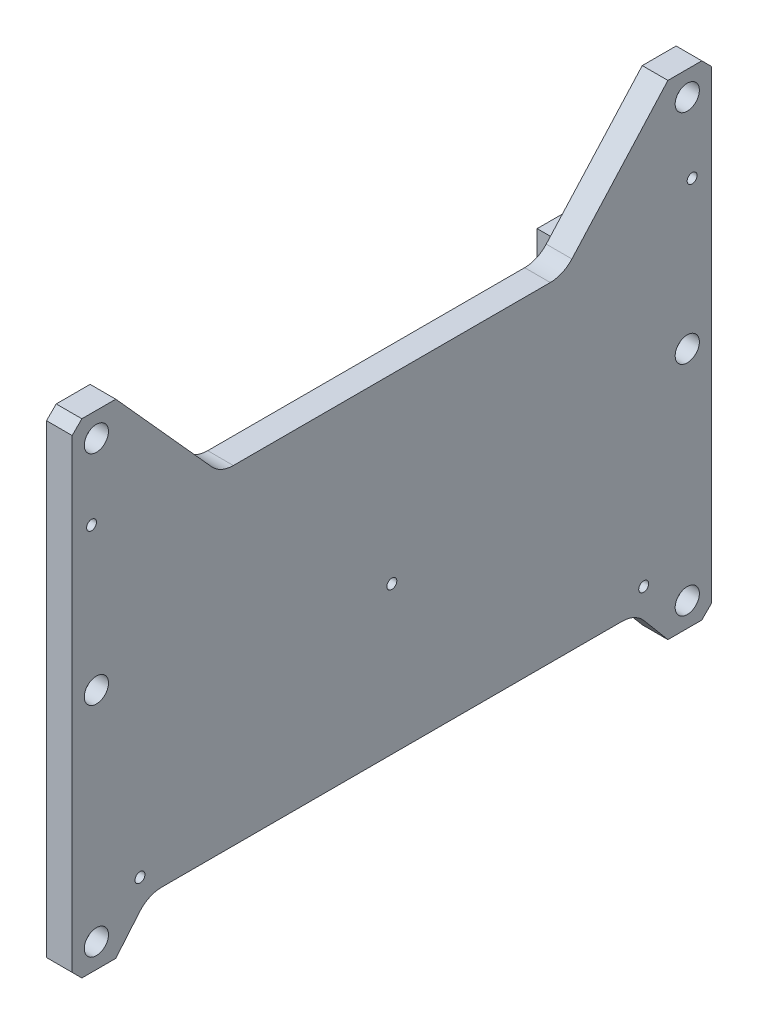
ISO-10303-21;
HEADER;
FILE_DESCRIPTION(('STEP AP214'),'2;1');
FILE_NAME('part.step','',(''),(''),'','','');
FILE_SCHEMA(('AUTOMOTIVE_DESIGN { 1 0 10303 214 1 1 1 1 }'));
ENDSEC;
DATA;
#1=APPLICATION_CONTEXT('core data for automotive mechanical design processes');
#2=APPLICATION_PROTOCOL_DEFINITION('international standard','automotive_design',2000,#1);
#3=PRODUCT_CONTEXT('',#1,'mechanical');
#4=PRODUCT('Part','Part','',(#3));
#5=PRODUCT_RELATED_PRODUCT_CATEGORY('part','',(#4));
#6=PRODUCT_DEFINITION_FORMATION('','',#4);
#7=PRODUCT_DEFINITION_CONTEXT('part definition',#1,'design');
#8=PRODUCT_DEFINITION('design','',#6,#7);
#9=PRODUCT_DEFINITION_SHAPE('','',#8);
#10=(LENGTH_UNIT() NAMED_UNIT(*) SI_UNIT(.MILLI.,.METRE.));
#11=(NAMED_UNIT(*) PLANE_ANGLE_UNIT() SI_UNIT($,.RADIAN.));
#12=(NAMED_UNIT(*) SI_UNIT($,.STERADIAN.) SOLID_ANGLE_UNIT());
#13=UNCERTAINTY_MEASURE_WITH_UNIT(LENGTH_MEASURE(1.E-05),#10,'distance_accuracy_value','');
#14=(GEOMETRIC_REPRESENTATION_CONTEXT(3) GLOBAL_UNCERTAINTY_ASSIGNED_CONTEXT((#13)) GLOBAL_UNIT_ASSIGNED_CONTEXT((#10,
#11,#12)) REPRESENTATION_CONTEXT('',''));
#15=CARTESIAN_POINT('',(0.,0.,0.));
#16=DIRECTION('',(0.,0.,1.));
#17=DIRECTION('',(1.,0.,0.));
#18=AXIS2_PLACEMENT_3D('',#15,#16,#17);
#19=CARTESIAN_POINT('',(0.,0.,0.));
#20=DIRECTION('',(-1.,0.,0.));
#21=DIRECTION('',(0.,0.,1.));
#22=AXIS2_PLACEMENT_3D('',#19,#20,#21);
#23=PLANE('',#22);
#24=CARTESIAN_POINT('',(0.,30.,-62.));
#25=DIRECTION('',(-1.,0.,0.));
#26=DIRECTION('',(0.,0.,1.));
#27=AXIS2_PLACEMENT_3D('',#24,#25,#26);
#28=CIRCLE('',#27,1.025);
#29=CARTESIAN_POINT('',(0.,30.,-60.975));
#30=VERTEX_POINT('',#29);
#31=EDGE_CURVE('E571',#30,#30,#28,.T.);
#32=ORIENTED_EDGE('',*,*,#31,.T.);
#33=EDGE_LOOP('',(#32));
#34=FACE_BOUND('',#33,.T.);
#35=CARTESIAN_POINT('',(0.,30.,62.));
#36=DIRECTION('',(-1.,0.,0.));
#37=DIRECTION('',(0.,0.,1.));
#38=AXIS2_PLACEMENT_3D('',#35,#36,#37);
#39=CIRCLE('',#38,1.025);
#40=CARTESIAN_POINT('',(0.,30.,63.025));
#41=VERTEX_POINT('',#40);
#42=EDGE_CURVE('E611',#41,#41,#39,.T.);
#43=ORIENTED_EDGE('',*,*,#42,.T.);
#44=EDGE_LOOP('',(#43));
#45=FACE_BOUND('',#44,.T.);
#46=CARTESIAN_POINT('',(0.,-38.,-52.));
#47=DIRECTION('',(-1.,0.,0.));
#48=DIRECTION('',(0.,0.,1.));
#49=AXIS2_PLACEMENT_3D('',#46,#47,#48);
#50=CIRCLE('',#49,1.025);
#51=CARTESIAN_POINT('',(0.,-38.,-50.975));
#52=VERTEX_POINT('',#51);
#53=EDGE_CURVE('E614',#52,#52,#50,.T.);
#54=ORIENTED_EDGE('',*,*,#53,.T.);
#55=EDGE_LOOP('',(#54));
#56=FACE_BOUND('',#55,.T.);
#57=CARTESIAN_POINT('',(0.,-38.,52.));
#58=DIRECTION('',(-1.,0.,0.));
#59=DIRECTION('',(0.,0.,1.));
#60=AXIS2_PLACEMENT_3D('',#57,#58,#59);
#61=CIRCLE('',#60,1.025);
#62=CARTESIAN_POINT('',(0.,-38.,53.025));
#63=VERTEX_POINT('',#62);
#64=EDGE_CURVE('E617',#63,#63,#61,.T.);
#65=ORIENTED_EDGE('',*,*,#64,.T.);
#66=EDGE_LOOP('',(#65));
#67=FACE_BOUND('',#66,.T.);
#68=CARTESIAN_POINT('',(0.,-11.5,0.));
#69=DIRECTION('',(-1.,0.,0.));
#70=DIRECTION('',(0.,0.,1.));
#71=AXIS2_PLACEMENT_3D('',#68,#69,#70);
#72=CIRCLE('',#71,1.025);
#73=CARTESIAN_POINT('',(0.,-11.5,1.025));
#74=VERTEX_POINT('',#73);
#75=EDGE_CURVE('E620',#74,#74,#72,.T.);
#76=ORIENTED_EDGE('',*,*,#75,.T.);
#77=EDGE_LOOP('',(#76));
#78=FACE_BOUND('',#77,.T.);
#79=CARTESIAN_POINT('',(0.,45.,61.));
#80=DIRECTION('',(1.,0.,0.));
#81=DIRECTION('',(0.,0.,-1.));
#82=AXIS2_PLACEMENT_3D('',#79,#80,#81);
#83=CIRCLE('',#82,2.5);
#84=CARTESIAN_POINT('',(0.,45.,58.5));
#85=VERTEX_POINT('',#84);
#86=EDGE_CURVE('E623',#85,#85,#83,.T.);
#87=ORIENTED_EDGE('',*,*,#86,.F.);
#88=EDGE_LOOP('',(#87));
#89=FACE_BOUND('',#88,.T.);
#90=CARTESIAN_POINT('',(0.,0.,61.));
#91=DIRECTION('',(1.,0.,0.));
#92=DIRECTION('',(0.,0.,-1.));
#93=AXIS2_PLACEMENT_3D('',#90,#91,#92);
#94=CIRCLE('',#93,2.5);
#95=CARTESIAN_POINT('',(0.,0.,58.5));
#96=VERTEX_POINT('',#95);
#97=EDGE_CURVE('E566',#96,#96,#94,.T.);
#98=ORIENTED_EDGE('',*,*,#97,.F.);
#99=EDGE_LOOP('',(#98));
#100=FACE_BOUND('',#99,.T.);
#101=CARTESIAN_POINT('',(0.,-45.,61.));
#102=DIRECTION('',(1.,0.,0.));
#103=DIRECTION('',(0.,0.,-1.));
#104=AXIS2_PLACEMENT_3D('',#101,#102,#103);
#105=CIRCLE('',#104,2.5);
#106=CARTESIAN_POINT('',(0.,-45.,58.5));
#107=VERTEX_POINT('',#106);
#108=EDGE_CURVE('E561',#107,#107,#105,.T.);
#109=ORIENTED_EDGE('',*,*,#108,.F.);
#110=EDGE_LOOP('',(#109));
#111=FACE_BOUND('',#110,.T.);
#112=CARTESIAN_POINT('',(0.,-45.,-61.));
#113=DIRECTION('',(1.,0.,0.));
#114=DIRECTION('',(0.,0.,-1.));
#115=AXIS2_PLACEMENT_3D('',#112,#113,#114);
#116=CIRCLE('',#115,2.5);
#117=CARTESIAN_POINT('',(0.,-45.,-63.5));
#118=VERTEX_POINT('',#117);
#119=EDGE_CURVE('E556',#118,#118,#116,.T.);
#120=ORIENTED_EDGE('',*,*,#119,.F.);
#121=EDGE_LOOP('',(#120));
#122=FACE_BOUND('',#121,.T.);
#123=CARTESIAN_POINT('',(0.,0.,-61.));
#124=DIRECTION('',(1.,0.,0.));
#125=DIRECTION('',(0.,0.,-1.));
#126=AXIS2_PLACEMENT_3D('',#123,#124,#125);
#127=CIRCLE('',#126,2.5);
#128=CARTESIAN_POINT('',(0.,0.,-63.5));
#129=VERTEX_POINT('',#128);
#130=EDGE_CURVE('E551',#129,#129,#127,.T.);
#131=ORIENTED_EDGE('',*,*,#130,.F.);
#132=EDGE_LOOP('',(#131));
#133=FACE_BOUND('',#132,.T.);
#134=CARTESIAN_POINT('',(0.,45.,-61.));
#135=DIRECTION('',(1.,0.,0.));
#136=DIRECTION('',(0.,0.,-1.));
#137=AXIS2_PLACEMENT_3D('',#134,#135,#136);
#138=CIRCLE('',#137,2.5);
#139=CARTESIAN_POINT('',(0.,45.,-63.5));
#140=VERTEX_POINT('',#139);
#141=EDGE_CURVE('E546',#140,#140,#138,.T.);
#142=ORIENTED_EDGE('',*,*,#141,.F.);
#143=EDGE_LOOP('',(#142));
#144=FACE_BOUND('',#143,.T.);
#145=DIRECTION('',(0.,0.,-1.));
#146=VECTOR('',#145,1.);
#147=CARTESIAN_POINT('',(0.,50.,57.));
#148=LINE('',#147,#146);
#149=CARTESIAN_POINT('',(0.,50.,64.));
#150=VERTEX_POINT('',#149);
#151=CARTESIAN_POINT('',(0.,50.,57.));
#152=VERTEX_POINT('',#151);
#153=EDGE_CURVE('E405',#150,#152,#148,.T.);
#154=ORIENTED_EDGE('',*,*,#153,.F.);
#155=DIRECTION('',(0.,0.707106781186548,-0.707106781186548));
#156=VECTOR('',#155,1.);
#157=CARTESIAN_POINT('',(0.,50.,64.));
#158=LINE('',#157,#156);
#159=CARTESIAN_POINT('',(0.,48.,66.));
#160=VERTEX_POINT('',#159);
#161=EDGE_CURVE('E437',#150,#160,#158,.F.);
#162=ORIENTED_EDGE('',*,*,#161,.T.);
#163=DIRECTION('',(0.,1.,0.));
#164=VECTOR('',#163,1.);
#165=CARTESIAN_POINT('',(0.,50.,66.));
#166=LINE('',#165,#164);
#167=CARTESIAN_POINT('',(0.,-48.,66.));
#168=VERTEX_POINT('',#167);
#169=EDGE_CURVE('E402',#168,#160,#166,.T.);
#170=ORIENTED_EDGE('',*,*,#169,.F.);
#171=DIRECTION('',(0.,0.707106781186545,0.70710678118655));
#172=VECTOR('',#171,1.);
#173=CARTESIAN_POINT('',(0.,-48.,66.));
#174=LINE('',#173,#172);
#175=CARTESIAN_POINT('',(0.,-50.,64.));
#176=VERTEX_POINT('',#175);
#177=EDGE_CURVE('E435',#168,#176,#174,.F.);
#178=ORIENTED_EDGE('',*,*,#177,.T.);
#179=DIRECTION('',(0.,0.,1.));
#180=VECTOR('',#179,1.);
#181=CARTESIAN_POINT('',(0.,-50.,57.));
#182=LINE('',#181,#180);
#183=CARTESIAN_POINT('',(0.,-50.,57.));
#184=VERTEX_POINT('',#183);
#185=EDGE_CURVE('E399',#184,#176,#182,.T.);
#186=ORIENTED_EDGE('',*,*,#185,.F.);
#187=DIRECTION('',(0.,-0.76604444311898,0.642787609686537));
#188=VECTOR('',#187,1.);
#189=CARTESIAN_POINT('',(0.,-50.,57.));
#190=LINE('',#189,#188);
#191=CARTESIAN_POINT('',(0.,-44.1432743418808,52.0856236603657));
#192=VERTEX_POINT('',#191);
#193=EDGE_CURVE('E397',#192,#184,#190,.T.);
#194=ORIENTED_EDGE('',*,*,#193,.F.);
#195=CARTESIAN_POINT('',(0.,-48.,47.4893570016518));
#196=DIRECTION('',(-1.,0.,0.));
#197=DIRECTION('',(0.,0.,1.));
#198=AXIS2_PLACEMENT_3D('',#195,#196,#197);
#199=CIRCLE('',#198,6.);
#200=CARTESIAN_POINT('',(0.,-42.,47.4893570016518));
#201=VERTEX_POINT('',#200);
#202=EDGE_CURVE('E484',#192,#201,#199,.T.);
#203=ORIENTED_EDGE('',*,*,#202,.T.);
#204=DIRECTION('',(0.,0.,1.));
#205=VECTOR('',#204,1.);
#206=CARTESIAN_POINT('',(0.,-42.,-50.2872029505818));
#207=LINE('',#206,#205);
#208=CARTESIAN_POINT('',(0.,-42.,-47.4893570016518));
#209=VERTEX_POINT('',#208);
#210=EDGE_CURVE('E394',#209,#201,#207,.T.);
#211=ORIENTED_EDGE('',*,*,#210,.F.);
#212=CARTESIAN_POINT('',(0.,-48.,-47.4893570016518));
#213=DIRECTION('',(-1.,0.,0.));
#214=DIRECTION('',(0.,0.,1.));
#215=AXIS2_PLACEMENT_3D('',#212,#213,#214);
#216=CIRCLE('',#215,6.);
#217=CARTESIAN_POINT('',(0.,-44.1432743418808,-52.0856236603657));
#218=VERTEX_POINT('',#217);
#219=EDGE_CURVE('E488',#209,#218,#216,.T.);
#220=ORIENTED_EDGE('',*,*,#219,.T.);
#221=DIRECTION('',(0.,0.76604444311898,0.642787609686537));
#222=VECTOR('',#221,1.);
#223=CARTESIAN_POINT('',(0.,-50.,-57.));
#224=LINE('',#223,#222);
#225=CARTESIAN_POINT('',(0.,-50.,-57.));
#226=VERTEX_POINT('',#225);
#227=EDGE_CURVE('E391',#226,#218,#224,.T.);
#228=ORIENTED_EDGE('',*,*,#227,.F.);
#229=DIRECTION('',(0.,0.,1.));
#230=VECTOR('',#229,1.);
#231=CARTESIAN_POINT('',(0.,-50.,-66.));
#232=LINE('',#231,#230);
#233=CARTESIAN_POINT('',(0.,-50.,-64.));
#234=VERTEX_POINT('',#233);
#235=EDGE_CURVE('E389',#234,#226,#232,.T.);
#236=ORIENTED_EDGE('',*,*,#235,.F.);
#237=DIRECTION('',(0.,-0.707106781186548,0.707106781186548));
#238=VECTOR('',#237,1.);
#239=CARTESIAN_POINT('',(0.,-50.,-64.));
#240=LINE('',#239,#238);
#241=CARTESIAN_POINT('',(0.,-48.,-66.));
#242=VERTEX_POINT('',#241);
#243=EDGE_CURVE('E433',#234,#242,#240,.F.);
#244=ORIENTED_EDGE('',*,*,#243,.T.);
#245=DIRECTION('',(0.,-1.,0.));
#246=VECTOR('',#245,1.);
#247=CARTESIAN_POINT('',(0.,50.,-66.));
#248=LINE('',#247,#246);
#249=CARTESIAN_POINT('',(0.,48.,-66.));
#250=VERTEX_POINT('',#249);
#251=EDGE_CURVE('E352',#250,#242,#248,.T.);
#252=ORIENTED_EDGE('',*,*,#251,.F.);
#253=DIRECTION('',(0.,-0.707106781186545,-0.70710678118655));
#254=VECTOR('',#253,1.);
#255=CARTESIAN_POINT('',(0.,48.,-66.));
#256=LINE('',#255,#254);
#257=CARTESIAN_POINT('',(0.,50.,-64.));
#258=VERTEX_POINT('',#257);
#259=EDGE_CURVE('E431',#250,#258,#256,.F.);
#260=ORIENTED_EDGE('',*,*,#259,.T.);
#261=DIRECTION('',(0.,0.,-1.));
#262=VECTOR('',#261,1.);
#263=CARTESIAN_POINT('',(0.,50.,-66.));
#264=LINE('',#263,#262);
#265=CARTESIAN_POINT('',(0.,50.,-57.));
#266=VERTEX_POINT('',#265);
#267=EDGE_CURVE('E357',#266,#258,#264,.T.);
#268=ORIENTED_EDGE('',*,*,#267,.F.);
#269=DIRECTION('',(0.,0.743144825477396,-0.669130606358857));
#270=VECTOR('',#269,1.);
#271=CARTESIAN_POINT('',(0.,50.,-57.));
#272=LINE('',#271,#270);
#273=CARTESIAN_POINT('',(0.,27.9852163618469,-37.1777997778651));
#274=VERTEX_POINT('',#273);
#275=EDGE_CURVE('E413',#274,#266,#272,.T.);
#276=ORIENTED_EDGE('',*,*,#275,.F.);
#277=CARTESIAN_POINT('',(0.,32.,-32.7189308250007));
#278=DIRECTION('',(-1.,0.,0.));
#279=DIRECTION('',(0.,0.,1.));
#280=AXIS2_PLACEMENT_3D('',#277,#278,#279);
#281=CIRCLE('',#280,6.);
#282=CARTESIAN_POINT('',(0.,26.,-32.7189308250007));
#283=VERTEX_POINT('',#282);
#284=EDGE_CURVE('E492',#274,#283,#281,.T.);
#285=ORIENTED_EDGE('',*,*,#284,.T.);
#286=DIRECTION('',(0.,0.,-1.));
#287=VECTOR('',#286,1.);
#288=CARTESIAN_POINT('',(0.,26.,-35.3903029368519));
#289=LINE('',#288,#287);
#290=CARTESIAN_POINT('',(0.,26.,32.7189308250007));
#291=VERTEX_POINT('',#290);
#292=EDGE_CURVE('E410',#291,#283,#289,.T.);
#293=ORIENTED_EDGE('',*,*,#292,.F.);
#294=CARTESIAN_POINT('',(0.,32.,32.7189308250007));
#295=DIRECTION('',(-1.,0.,0.));
#296=DIRECTION('',(0.,0.,1.));
#297=AXIS2_PLACEMENT_3D('',#294,#295,#296);
#298=CIRCLE('',#297,6.);
#299=CARTESIAN_POINT('',(0.,27.9852163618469,37.1777997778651));
#300=VERTEX_POINT('',#299);
#301=EDGE_CURVE('E496',#291,#300,#298,.T.);
#302=ORIENTED_EDGE('',*,*,#301,.T.);
#303=DIRECTION('',(0.,-0.743144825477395,-0.669130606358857));
#304=VECTOR('',#303,1.);
#305=CARTESIAN_POINT('',(0.,50.,57.));
#306=LINE('',#305,#304);
#307=EDGE_CURVE('E407',#152,#300,#306,.T.);
#308=ORIENTED_EDGE('',*,*,#307,.F.);
#309=EDGE_LOOP('',(#154,#162,#170,#178,#186,#194,#203,#211,#220,#228,#236,#244,#252,#260,#268,
#276,#285,#293,#302,#308));
#310=FACE_BOUND('',#309,.T.);
#311=ADVANCED_FACE('F41',(#34,#45,#56,#67,#78,#89,#100,#111,#122,#133,#144,#310),#23,.F.);
#312=CARTESIAN_POINT('',(-5.3,0.,0.));
#313=DIRECTION('',(-1.,0.,0.));
#314=DIRECTION('',(0.,0.,1.));
#315=AXIS2_PLACEMENT_3D('',#312,#313,#314);
#316=PLANE('',#315);
#317=CARTESIAN_POINT('',(-5.3,30.,-62.));
#318=DIRECTION('',(-1.,0.,0.));
#319=DIRECTION('',(0.,0.,1.));
#320=AXIS2_PLACEMENT_3D('',#317,#318,#319);
#321=CIRCLE('',#320,2.6);
#322=CARTESIAN_POINT('',(-5.3,30.,-59.4));
#323=VERTEX_POINT('',#322);
#324=EDGE_CURVE('E1415',#323,#323,#321,.T.);
#325=ORIENTED_EDGE('',*,*,#324,.F.);
#326=EDGE_LOOP('',(#325));
#327=FACE_BOUND('',#326,.T.);
#328=CARTESIAN_POINT('',(-5.3,-11.5,0.));
#329=DIRECTION('',(-1.,0.,0.));
#330=DIRECTION('',(0.,0.,1.));
#331=AXIS2_PLACEMENT_3D('',#328,#329,#330);
#332=CIRCLE('',#331,2.6);
#333=CARTESIAN_POINT('',(-5.3,-11.5,2.6));
#334=VERTEX_POINT('',#333);
#335=EDGE_CURVE('E591',#334,#334,#332,.T.);
#336=ORIENTED_EDGE('',*,*,#335,.F.);
#337=EDGE_LOOP('',(#336));
#338=FACE_BOUND('',#337,.T.);
#339=CARTESIAN_POINT('',(-5.3,30.,62.));
#340=DIRECTION('',(-1.,0.,0.));
#341=DIRECTION('',(0.,0.,1.));
#342=AXIS2_PLACEMENT_3D('',#339,#340,#341);
#343=CIRCLE('',#342,2.6);
#344=CARTESIAN_POINT('',(-5.3,30.,64.6));
#345=VERTEX_POINT('',#344);
#346=EDGE_CURVE('E584',#345,#345,#343,.T.);
#347=ORIENTED_EDGE('',*,*,#346,.F.);
#348=EDGE_LOOP('',(#347));
#349=FACE_BOUND('',#348,.T.);
#350=CARTESIAN_POINT('',(-5.3,-38.,52.));
#351=DIRECTION('',(-1.,0.,0.));
#352=DIRECTION('',(0.,0.,1.));
#353=AXIS2_PLACEMENT_3D('',#350,#351,#352);
#354=CIRCLE('',#353,2.6);
#355=CARTESIAN_POINT('',(-5.3,-38.,54.6));
#356=VERTEX_POINT('',#355);
#357=EDGE_CURVE('E580',#356,#356,#354,.T.);
#358=ORIENTED_EDGE('',*,*,#357,.F.);
#359=EDGE_LOOP('',(#358));
#360=FACE_BOUND('',#359,.T.);
#361=CARTESIAN_POINT('',(-5.3,-38.,-52.));
#362=DIRECTION('',(-1.,0.,0.));
#363=DIRECTION('',(0.,0.,1.));
#364=AXIS2_PLACEMENT_3D('',#361,#362,#363);
#365=CIRCLE('',#364,2.6);
#366=CARTESIAN_POINT('',(-5.3,-38.,-49.4));
#367=VERTEX_POINT('',#366);
#368=EDGE_CURVE('E576',#367,#367,#365,.T.);
#369=ORIENTED_EDGE('',*,*,#368,.F.);
#370=EDGE_LOOP('',(#369));
#371=FACE_BOUND('',#370,.T.);
#372=CARTESIAN_POINT('',(-5.3,45.,61.));
#373=DIRECTION('',(-1.,0.,0.));
#374=DIRECTION('',(0.,0.,1.));
#375=AXIS2_PLACEMENT_3D('',#372,#373,#374);
#376=CIRCLE('',#375,1.64999999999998);
#377=CARTESIAN_POINT('',(-5.3,45.,62.65));
#378=VERTEX_POINT('',#377);
#379=EDGE_CURVE('E536',#378,#378,#376,.T.);
#380=ORIENTED_EDGE('',*,*,#379,.F.);
#381=EDGE_LOOP('',(#380));
#382=FACE_BOUND('',#381,.T.);
#383=CARTESIAN_POINT('',(-5.3,45.,-61.));
#384=DIRECTION('',(-1.,0.,0.));
#385=DIRECTION('',(0.,0.,1.));
#386=AXIS2_PLACEMENT_3D('',#383,#384,#385);
#387=CIRCLE('',#386,1.64999999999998);
#388=CARTESIAN_POINT('',(-5.3,45.,-59.35));
#389=VERTEX_POINT('',#388);
#390=EDGE_CURVE('E532',#389,#389,#387,.T.);
#391=ORIENTED_EDGE('',*,*,#390,.F.);
#392=EDGE_LOOP('',(#391));
#393=FACE_BOUND('',#392,.T.);
#394=CARTESIAN_POINT('',(-5.3,-45.,-61.));
#395=DIRECTION('',(-1.,0.,0.));
#396=DIRECTION('',(0.,0.,1.));
#397=AXIS2_PLACEMENT_3D('',#394,#395,#396);
#398=CIRCLE('',#397,1.64999999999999);
#399=CARTESIAN_POINT('',(-5.3,-45.,-59.35));
#400=VERTEX_POINT('',#399);
#401=EDGE_CURVE('E535',#400,#400,#398,.T.);
#402=ORIENTED_EDGE('',*,*,#401,.F.);
#403=EDGE_LOOP('',(#402));
#404=FACE_BOUND('',#403,.T.);
#405=CARTESIAN_POINT('',(-5.3,-45.,61.));
#406=DIRECTION('',(-1.,0.,0.));
#407=DIRECTION('',(0.,0.,1.));
#408=AXIS2_PLACEMENT_3D('',#405,#406,#407);
#409=CIRCLE('',#408,1.64999999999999);
#410=CARTESIAN_POINT('',(-5.3,-45.,62.65));
#411=VERTEX_POINT('',#410);
#412=EDGE_CURVE('E650',#411,#411,#409,.T.);
#413=ORIENTED_EDGE('',*,*,#412,.F.);
#414=EDGE_LOOP('',(#413));
#415=FACE_BOUND('',#414,.T.);
#416=CARTESIAN_POINT('',(-5.3,0.,61.));
#417=DIRECTION('',(-1.,0.,0.));
#418=DIRECTION('',(0.,0.,1.));
#419=AXIS2_PLACEMENT_3D('',#416,#417,#418);
#420=CIRCLE('',#419,1.64999999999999);
#421=CARTESIAN_POINT('',(-5.3,0.,62.65));
#422=VERTEX_POINT('',#421);
#423=EDGE_CURVE('E653',#422,#422,#420,.T.);
#424=ORIENTED_EDGE('',*,*,#423,.F.);
#425=EDGE_LOOP('',(#424));
#426=FACE_BOUND('',#425,.T.);
#427=CARTESIAN_POINT('',(-5.3,0.,-61.));
#428=DIRECTION('',(-1.,0.,0.));
#429=DIRECTION('',(0.,0.,1.));
#430=AXIS2_PLACEMENT_3D('',#427,#428,#429);
#431=CIRCLE('',#430,1.64999999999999);
#432=CARTESIAN_POINT('',(-5.3,0.,-59.35));
#433=VERTEX_POINT('',#432);
#434=EDGE_CURVE('E656',#433,#433,#431,.T.);
#435=ORIENTED_EDGE('',*,*,#434,.F.);
#436=EDGE_LOOP('',(#435));
#437=FACE_BOUND('',#436,.T.);
#438=DIRECTION('',(0.,-1.,0.));
#439=VECTOR('',#438,1.);
#440=CARTESIAN_POINT('',(-5.3,-8.,18.));
#441=LINE('',#440,#439);
#442=CARTESIAN_POINT('',(-5.3,-11.,18.));
#443=VERTEX_POINT('',#442);
#444=CARTESIAN_POINT('',(-5.3,-31.,18.));
#445=VERTEX_POINT('',#444);
#446=EDGE_CURVE('E659',#443,#445,#441,.T.);
#447=ORIENTED_EDGE('',*,*,#446,.F.);
#448=CARTESIAN_POINT('',(-5.3,-11.,21.));
#449=DIRECTION('',(-1.,0.,0.));
#450=DIRECTION('',(0.,0.,1.));
#451=AXIS2_PLACEMENT_3D('',#448,#449,#450);
#452=CIRCLE('',#451,3.);
#453=CARTESIAN_POINT('',(-5.3,-8.,21.));
#454=VERTEX_POINT('',#453);
#455=EDGE_CURVE('E11',#443,#454,#452,.F.);
#456=ORIENTED_EDGE('',*,*,#455,.T.);
#457=DIRECTION('',(0.,0.,-1.));
#458=VECTOR('',#457,1.);
#459=CARTESIAN_POINT('',(-5.3,-8.,18.));
#460=LINE('',#459,#458);
#461=CARTESIAN_POINT('',(-5.3,-8.,52.));
#462=VERTEX_POINT('',#461);
#463=EDGE_CURVE('E664',#462,#454,#460,.T.);
#464=ORIENTED_EDGE('',*,*,#463,.F.);
#465=CARTESIAN_POINT('',(-5.3,-11.,52.));
#466=DIRECTION('',(-1.,0.,0.));
#467=DIRECTION('',(0.,0.,1.));
#468=AXIS2_PLACEMENT_3D('',#465,#466,#467);
#469=CIRCLE('',#468,3.);
#470=CARTESIAN_POINT('',(-5.3,-11.,55.));
#471=VERTEX_POINT('',#470);
#472=EDGE_CURVE('E529',#462,#471,#469,.F.);
#473=ORIENTED_EDGE('',*,*,#472,.T.);
#474=DIRECTION('',(0.,1.,0.));
#475=VECTOR('',#474,1.);
#476=CARTESIAN_POINT('',(-5.3,-8.,55.));
#477=LINE('',#476,#475);
#478=CARTESIAN_POINT('',(-5.3,-31.,55.));
#479=VERTEX_POINT('',#478);
#480=EDGE_CURVE('E678',#479,#471,#477,.T.);
#481=ORIENTED_EDGE('',*,*,#480,.F.);
#482=CARTESIAN_POINT('',(-5.3,-31.,52.));
#483=DIRECTION('',(-1.,0.,0.));
#484=DIRECTION('',(0.,0.,1.));
#485=AXIS2_PLACEMENT_3D('',#482,#483,#484);
#486=CIRCLE('',#485,3.);
#487=CARTESIAN_POINT('',(-5.3,-34.,52.));
#488=VERTEX_POINT('',#487);
#489=EDGE_CURVE('E527',#479,#488,#486,.F.);
#490=ORIENTED_EDGE('',*,*,#489,.T.);
#491=DIRECTION('',(0.,0.,1.));
#492=VECTOR('',#491,1.);
#493=CARTESIAN_POINT('',(-5.3,-34.,18.));
#494=LINE('',#493,#492);
#495=CARTESIAN_POINT('',(-5.3,-34.,21.));
#496=VERTEX_POINT('',#495);
#497=EDGE_CURVE('E675',#496,#488,#494,.T.);
#498=ORIENTED_EDGE('',*,*,#497,.F.);
#499=CARTESIAN_POINT('',(-5.3,-31.,21.));
#500=DIRECTION('',(-1.,0.,0.));
#501=DIRECTION('',(0.,0.,1.));
#502=AXIS2_PLACEMENT_3D('',#499,#500,#501);
#503=CIRCLE('',#502,3.);
#504=EDGE_CURVE('E50',#496,#445,#503,.F.);
#505=ORIENTED_EDGE('',*,*,#504,.T.);
#506=EDGE_LOOP('',(#447,#456,#464,#473,#481,#490,#498,#505));
#507=FACE_BOUND('',#506,.T.);
#508=DIRECTION('',(0.,1.,0.));
#509=VECTOR('',#508,1.);
#510=CARTESIAN_POINT('',(-5.3,50.,66.));
#511=LINE('',#510,#509);
#512=CARTESIAN_POINT('',(-5.3,-48.,66.));
#513=VERTEX_POINT('',#512);
#514=CARTESIAN_POINT('',(-5.3,48.,66.));
#515=VERTEX_POINT('',#514);
#516=EDGE_CURVE('E370',#513,#515,#511,.T.);
#517=ORIENTED_EDGE('',*,*,#516,.T.);
#518=DIRECTION('',(0.,-0.707106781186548,0.707106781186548));
#519=VECTOR('',#518,1.);
#520=CARTESIAN_POINT('',(-5.3,57.,57.));
#521=LINE('',#520,#519);
#522=CARTESIAN_POINT('',(-5.3,50.,64.));
#523=VERTEX_POINT('',#522);
#524=EDGE_CURVE('E450',#515,#523,#521,.F.);
#525=ORIENTED_EDGE('',*,*,#524,.T.);
#526=DIRECTION('',(0.,0.,-1.));
#527=VECTOR('',#526,1.);
#528=CARTESIAN_POINT('',(-5.3,50.,57.));
#529=LINE('',#528,#527);
#530=CARTESIAN_POINT('',(-5.3,50.,57.));
#531=VERTEX_POINT('',#530);
#532=EDGE_CURVE('E373',#523,#531,#529,.T.);
#533=ORIENTED_EDGE('',*,*,#532,.T.);
#534=DIRECTION('',(0.,-0.743144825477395,-0.669130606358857));
#535=VECTOR('',#534,1.);
#536=CARTESIAN_POINT('',(-5.3,50.,57.));
#537=LINE('',#536,#535);
#538=CARTESIAN_POINT('',(-5.3,27.9852163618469,37.1777997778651));
#539=VERTEX_POINT('',#538);
#540=EDGE_CURVE('E375',#531,#539,#537,.T.);
#541=ORIENTED_EDGE('',*,*,#540,.T.);
#542=CARTESIAN_POINT('',(-5.3,32.,32.7189308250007));
#543=DIRECTION('',(-1.,0.,0.));
#544=DIRECTION('',(0.,0.,1.));
#545=AXIS2_PLACEMENT_3D('',#542,#543,#544);
#546=CIRCLE('',#545,6.);
#547=CARTESIAN_POINT('',(-5.3,26.,32.7189308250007));
#548=VERTEX_POINT('',#547);
#549=EDGE_CURVE('E498',#539,#548,#546,.F.);
#550=ORIENTED_EDGE('',*,*,#549,.T.);
#551=DIRECTION('',(0.,0.,-1.));
#552=VECTOR('',#551,1.);
#553=CARTESIAN_POINT('',(-5.3,26.,-35.3903029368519));
#554=LINE('',#553,#552);
#555=CARTESIAN_POINT('',(-5.3,26.,-32.7189308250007));
#556=VERTEX_POINT('',#555);
#557=EDGE_CURVE('E378',#548,#556,#554,.T.);
#558=ORIENTED_EDGE('',*,*,#557,.T.);
#559=CARTESIAN_POINT('',(-5.3,32.,-32.7189308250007));
#560=DIRECTION('',(-1.,0.,0.));
#561=DIRECTION('',(0.,0.,1.));
#562=AXIS2_PLACEMENT_3D('',#559,#560,#561);
#563=CIRCLE('',#562,6.);
#564=CARTESIAN_POINT('',(-5.3,27.9852163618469,-37.1777997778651));
#565=VERTEX_POINT('',#564);
#566=EDGE_CURVE('E494',#556,#565,#563,.F.);
#567=ORIENTED_EDGE('',*,*,#566,.T.);
#568=DIRECTION('',(0.,0.743144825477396,-0.669130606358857));
#569=VECTOR('',#568,1.);
#570=CARTESIAN_POINT('',(-5.3,50.,-57.));
#571=LINE('',#570,#569);
#572=CARTESIAN_POINT('',(-5.3,50.,-57.));
#573=VERTEX_POINT('',#572);
#574=EDGE_CURVE('E381',#565,#573,#571,.T.);
#575=ORIENTED_EDGE('',*,*,#574,.T.);
#576=DIRECTION('',(0.,0.,-1.));
#577=VECTOR('',#576,1.);
#578=CARTESIAN_POINT('',(-5.3,50.,-66.));
#579=LINE('',#578,#577);
#580=CARTESIAN_POINT('',(-5.3,50.,-64.));
#581=VERTEX_POINT('',#580);
#582=EDGE_CURVE('E383',#573,#581,#579,.T.);
#583=ORIENTED_EDGE('',*,*,#582,.T.);
#584=DIRECTION('',(0.,0.707106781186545,0.70710678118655));
#585=VECTOR('',#584,1.);
#586=CARTESIAN_POINT('',(-5.3,57.0000000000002,-56.9999999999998));
#587=LINE('',#586,#585);
#588=CARTESIAN_POINT('',(-5.3,48.,-66.));
#589=VERTEX_POINT('',#588);
#590=EDGE_CURVE('E444',#581,#589,#587,.F.);
#591=ORIENTED_EDGE('',*,*,#590,.T.);
#592=DIRECTION('',(0.,-1.,0.));
#593=VECTOR('',#592,1.);
#594=CARTESIAN_POINT('',(-5.3,50.,-66.));
#595=LINE('',#594,#593);
#596=CARTESIAN_POINT('',(-5.3,-48.,-66.));
#597=VERTEX_POINT('',#596);
#598=EDGE_CURVE('E353',#589,#597,#595,.T.);
#599=ORIENTED_EDGE('',*,*,#598,.T.);
#600=DIRECTION('',(0.,0.707106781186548,-0.707106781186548));
#601=VECTOR('',#600,1.);
#602=CARTESIAN_POINT('',(-5.3,-57.,-57.));
#603=LINE('',#602,#601);
#604=CARTESIAN_POINT('',(-5.3,-50.,-64.));
#605=VERTEX_POINT('',#604);
#606=EDGE_CURVE('E446',#597,#605,#603,.F.);
#607=ORIENTED_EDGE('',*,*,#606,.T.);
#608=DIRECTION('',(0.,0.,1.));
#609=VECTOR('',#608,1.);
#610=CARTESIAN_POINT('',(-5.3,-50.,-66.));
#611=LINE('',#610,#609);
#612=CARTESIAN_POINT('',(-5.3,-50.,-57.));
#613=VERTEX_POINT('',#612);
#614=EDGE_CURVE('E356',#605,#613,#611,.T.);
#615=ORIENTED_EDGE('',*,*,#614,.T.);
#616=DIRECTION('',(0.,0.76604444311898,0.642787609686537));
#617=VECTOR('',#616,1.);
#618=CARTESIAN_POINT('',(-5.3,-50.,-57.));
#619=LINE('',#618,#617);
#620=CARTESIAN_POINT('',(-5.3,-44.1432743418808,-52.0856236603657));
#621=VERTEX_POINT('',#620);
#622=EDGE_CURVE('E359',#613,#621,#619,.T.);
#623=ORIENTED_EDGE('',*,*,#622,.T.);
#624=CARTESIAN_POINT('',(-5.3,-48.,-47.4893570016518));
#625=DIRECTION('',(-1.,0.,0.));
#626=DIRECTION('',(0.,0.,1.));
#627=AXIS2_PLACEMENT_3D('',#624,#625,#626);
#628=CIRCLE('',#627,6.);
#629=CARTESIAN_POINT('',(-5.3,-42.,-47.4893570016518));
#630=VERTEX_POINT('',#629);
#631=EDGE_CURVE('E490',#621,#630,#628,.F.);
#632=ORIENTED_EDGE('',*,*,#631,.T.);
#633=DIRECTION('',(0.,0.,1.));
#634=VECTOR('',#633,1.);
#635=CARTESIAN_POINT('',(-5.3,-42.,-50.2872029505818));
#636=LINE('',#635,#634);
#637=CARTESIAN_POINT('',(-5.3,-42.,47.4893570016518));
#638=VERTEX_POINT('',#637);
#639=EDGE_CURVE('E362',#630,#638,#636,.T.);
#640=ORIENTED_EDGE('',*,*,#639,.T.);
#641=CARTESIAN_POINT('',(-5.3,-48.,47.4893570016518));
#642=DIRECTION('',(-1.,0.,0.));
#643=DIRECTION('',(0.,0.,1.));
#644=AXIS2_PLACEMENT_3D('',#641,#642,#643);
#645=CIRCLE('',#644,6.);
#646=CARTESIAN_POINT('',(-5.3,-44.1432743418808,52.0856236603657));
#647=VERTEX_POINT('',#646);
#648=EDGE_CURVE('E486',#638,#647,#645,.F.);
#649=ORIENTED_EDGE('',*,*,#648,.T.);
#650=DIRECTION('',(0.,-0.76604444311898,0.642787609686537));
#651=VECTOR('',#650,1.);
#652=CARTESIAN_POINT('',(-5.3,-50.,57.));
#653=LINE('',#652,#651);
#654=CARTESIAN_POINT('',(-5.3,-50.,57.));
#655=VERTEX_POINT('',#654);
#656=EDGE_CURVE('E365',#647,#655,#653,.T.);
#657=ORIENTED_EDGE('',*,*,#656,.T.);
#658=DIRECTION('',(0.,0.,1.));
#659=VECTOR('',#658,1.);
#660=CARTESIAN_POINT('',(-5.3,-50.,57.));
#661=LINE('',#660,#659);
#662=CARTESIAN_POINT('',(-5.3,-50.,64.));
#663=VERTEX_POINT('',#662);
#664=EDGE_CURVE('E367',#655,#663,#661,.T.);
#665=ORIENTED_EDGE('',*,*,#664,.T.);
#666=DIRECTION('',(0.,-0.707106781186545,-0.70710678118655));
#667=VECTOR('',#666,1.);
#668=CARTESIAN_POINT('',(-5.3,-57.0000000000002,56.9999999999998));
#669=LINE('',#668,#667);
#670=EDGE_CURVE('E448',#663,#513,#669,.F.);
#671=ORIENTED_EDGE('',*,*,#670,.T.);
#672=EDGE_LOOP('',(#517,#525,#533,#541,#550,#558,#567,#575,#583,#591,#599,#607,#615,#623,#632,
#640,#649,#657,#665,#671));
#673=FACE_BOUND('',#672,.T.);
#674=DIRECTION('',(0.,1.,0.));
#675=VECTOR('',#674,1.);
#676=CARTESIAN_POINT('',(-5.3,0.,-51.));
#677=LINE('',#676,#675);
#678=CARTESIAN_POINT('',(-5.3,-33.,-51.));
#679=VERTEX_POINT('',#678);
#680=CARTESIAN_POINT('',(-5.3,4.99999999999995,-51.));
#681=VERTEX_POINT('',#680);
#682=EDGE_CURVE('E698',#679,#681,#677,.T.);
#683=ORIENTED_EDGE('',*,*,#682,.T.);
#684=CARTESIAN_POINT('',(-5.3,5.,-57.));
#685=DIRECTION('',(-1.,0.,0.));
#686=DIRECTION('',(0.,0.,1.));
#687=AXIS2_PLACEMENT_3D('',#684,#685,#686);
#688=CIRCLE('',#687,6.);
#689=CARTESIAN_POINT('',(-5.3,11.,-57.));
#690=VERTEX_POINT('',#689);
#691=EDGE_CURVE('E673',#690,#681,#688,.F.);
#692=ORIENTED_EDGE('',*,*,#691,.F.);
#693=DIRECTION('',(0.,0.,1.));
#694=VECTOR('',#693,1.);
#695=CARTESIAN_POINT('',(-5.3,11.,-60.));
#696=LINE('',#695,#694);
#697=CARTESIAN_POINT('',(-5.3,11.,-60.));
#698=VERTEX_POINT('',#697);
#699=EDGE_CURVE('E319',#698,#690,#696,.T.);
#700=ORIENTED_EDGE('',*,*,#699,.F.);
#701=DIRECTION('',(0.,-1.,0.));
#702=VECTOR('',#701,1.);
#703=CARTESIAN_POINT('',(-5.3,27.,-60.));
#704=LINE('',#703,#702);
#705=CARTESIAN_POINT('',(-5.3,27.,-60.));
#706=VERTEX_POINT('',#705);
#707=EDGE_CURVE('E320',#706,#698,#704,.T.);
#708=ORIENTED_EDGE('',*,*,#707,.F.);
#709=DIRECTION('',(0.,0.,-1.));
#710=VECTOR('',#709,1.);
#711=CARTESIAN_POINT('',(-5.3,27.,-60.));
#712=LINE('',#711,#710);
#713=CARTESIAN_POINT('',(-5.3,27.,-40.));
#714=VERTEX_POINT('',#713);
#715=EDGE_CURVE('E332',#714,#706,#712,.T.);
#716=ORIENTED_EDGE('',*,*,#715,.F.);
#717=DIRECTION('',(0.,1.,0.));
#718=VECTOR('',#717,1.);
#719=CARTESIAN_POINT('',(-5.3,27.,-40.));
#720=LINE('',#719,#718);
#721=CARTESIAN_POINT('',(-5.3,10.,-40.));
#722=VERTEX_POINT('',#721);
#723=EDGE_CURVE('E340',#722,#714,#720,.T.);
#724=ORIENTED_EDGE('',*,*,#723,.F.);
#725=CARTESIAN_POINT('',(-5.3,10.,-34.));
#726=DIRECTION('',(-1.,0.,0.));
#727=DIRECTION('',(0.,0.,1.));
#728=AXIS2_PLACEMENT_3D('',#725,#726,#727);
#729=CIRCLE('',#728,6.);
#730=CARTESIAN_POINT('',(-5.3,4.,-34.));
#731=VERTEX_POINT('',#730);
#732=EDGE_CURVE('E314',#722,#731,#729,.T.);
#733=ORIENTED_EDGE('',*,*,#732,.T.);
#734=DIRECTION('',(0.,0.,1.));
#735=VECTOR('',#734,1.);
#736=CARTESIAN_POINT('',(-5.3,4.,0.));
#737=LINE('',#736,#735);
#738=CARTESIAN_POINT('',(-5.3,4.,-15.));
#739=VERTEX_POINT('',#738);
#740=EDGE_CURVE('E707',#731,#739,#737,.T.);
#741=ORIENTED_EDGE('',*,*,#740,.T.);
#742=DIRECTION('',(0.,-1.,0.));
#743=VECTOR('',#742,1.);
#744=CARTESIAN_POINT('',(-5.3,0.,-15.));
#745=LINE('',#744,#743);
#746=CARTESIAN_POINT('',(-5.3,-33.,-15.));
#747=VERTEX_POINT('',#746);
#748=EDGE_CURVE('E704',#739,#747,#745,.T.);
#749=ORIENTED_EDGE('',*,*,#748,.T.);
#750=DIRECTION('',(0.,0.,1.));
#751=VECTOR('',#750,1.);
#752=CARTESIAN_POINT('',(-5.3,-33.,0.));
#753=LINE('',#752,#751);
#754=EDGE_CURVE('E701',#679,#747,#753,.T.);
#755=ORIENTED_EDGE('',*,*,#754,.F.);
#756=EDGE_LOOP('',(#683,#692,#700,#708,#716,#724,#733,#741,#749,#755));
#757=FACE_BOUND('',#756,.T.);
#758=ADVANCED_FACE('F728',(#327,#338,#349,#360,#371,#382,#393,#404,#415,#426,#437,#507,#673,
#757),#316,.T.);
#759=CARTESIAN_POINT('',(-10.,11.,-60.));
#760=DIRECTION('',(0.,1.,0.));
#761=DIRECTION('',(0.,0.,1.));
#762=AXIS2_PLACEMENT_3D('',#759,#760,#761);
#763=PLANE('',#762);
#764=DIRECTION('',(1.,0.,0.));
#765=VECTOR('',#764,1.);
#766=CARTESIAN_POINT('',(-9.1,11.,-57.));
#767=LINE('',#766,#765);
#768=CARTESIAN_POINT('',(-9.1,11.,-57.));
#769=VERTEX_POINT('',#768);
#770=EDGE_CURVE('E297',#769,#690,#767,.T.);
#771=ORIENTED_EDGE('',*,*,#770,.F.);
#772=DIRECTION('',(0.,0.,-1.));
#773=VECTOR('',#772,1.);
#774=CARTESIAN_POINT('',(-9.1,11.,0.));
#775=LINE('',#774,#773);
#776=CARTESIAN_POINT('',(-9.1,11.,-40.));
#777=VERTEX_POINT('',#776);
#778=EDGE_CURVE('E304',#777,#769,#775,.T.);
#779=ORIENTED_EDGE('',*,*,#778,.F.);
#780=DIRECTION('',(1.,0.,0.));
#781=VECTOR('',#780,1.);
#782=CARTESIAN_POINT('',(-10.,11.,-40.));
#783=LINE('',#782,#781);
#784=CARTESIAN_POINT('',(-10.,11.,-40.));
#785=VERTEX_POINT('',#784);
#786=EDGE_CURVE('E348',#785,#777,#783,.T.);
#787=ORIENTED_EDGE('',*,*,#786,.F.);
#788=DIRECTION('',(0.,0.,1.));
#789=VECTOR('',#788,1.);
#790=CARTESIAN_POINT('',(-10.,11.,-60.));
#791=LINE('',#790,#789);
#792=CARTESIAN_POINT('',(-10.,11.,-60.));
#793=VERTEX_POINT('',#792);
#794=EDGE_CURVE('E331',#793,#785,#791,.T.);
#795=ORIENTED_EDGE('',*,*,#794,.F.);
#796=DIRECTION('',(1.,0.,0.));
#797=VECTOR('',#796,1.);
#798=CARTESIAN_POINT('',(-10.,11.,-60.));
#799=LINE('',#798,#797);
#800=EDGE_CURVE('E350',#793,#698,#799,.T.);
#801=ORIENTED_EDGE('',*,*,#800,.T.);
#802=ORIENTED_EDGE('',*,*,#699,.T.);
#803=EDGE_LOOP('',(#771,#779,#787,#795,#801,#802));
#804=FACE_BOUND('',#803,.T.);
#805=ADVANCED_FACE('F317',(#804),#763,.F.);
#806=CARTESIAN_POINT('',(-5.3,50.,-66.));
#807=DIRECTION('',(0.,0.,1.));
#808=DIRECTION('',(1.,0.,0.));
#809=AXIS2_PLACEMENT_3D('',#806,#807,#808);
#810=PLANE('',#809);
#811=ORIENTED_EDGE('',*,*,#251,.T.);
#812=DIRECTION('',(-1.,0.,0.));
#813=VECTOR('',#812,1.);
#814=CARTESIAN_POINT('',(-5.3,-48.,-66.));
#815=LINE('',#814,#813);
#816=EDGE_CURVE('E460',#242,#597,#815,.T.);
#817=ORIENTED_EDGE('',*,*,#816,.T.);
#818=ORIENTED_EDGE('',*,*,#598,.F.);
#819=DIRECTION('',(1.,0.,0.));
#820=VECTOR('',#819,1.);
#821=CARTESIAN_POINT('',(-5.3,48.,-66.));
#822=LINE('',#821,#820);
#823=EDGE_CURVE('E457',#589,#250,#822,.T.);
#824=ORIENTED_EDGE('',*,*,#823,.T.);
#825=EDGE_LOOP('',(#811,#817,#818,#824));
#826=FACE_BOUND('',#825,.T.);
#827=ADVANCED_FACE('F819',(#826),#810,.F.);
#828=CARTESIAN_POINT('',(-5.3,-50.,-66.));
#829=DIRECTION('',(0.,1.,0.));
#830=DIRECTION('',(0.,0.,1.));
#831=AXIS2_PLACEMENT_3D('',#828,#829,#830);
#832=PLANE('',#831);
#833=ORIENTED_EDGE('',*,*,#614,.F.);
#834=DIRECTION('',(1.,0.,0.));
#835=VECTOR('',#834,1.);
#836=CARTESIAN_POINT('',(-5.3,-50.,-64.));
#837=LINE('',#836,#835);
#838=EDGE_CURVE('E454',#605,#234,#837,.T.);
#839=ORIENTED_EDGE('',*,*,#838,.T.);
#840=ORIENTED_EDGE('',*,*,#235,.T.);
#841=DIRECTION('',(1.,0.,0.));
#842=VECTOR('',#841,1.);
#843=CARTESIAN_POINT('',(-5.3,-50.,-57.));
#844=LINE('',#843,#842);
#845=EDGE_CURVE('E425',#613,#226,#844,.T.);
#846=ORIENTED_EDGE('',*,*,#845,.F.);
#847=EDGE_LOOP('',(#833,#839,#840,#846));
#848=FACE_BOUND('',#847,.T.);
#849=ADVANCED_FACE('F815',(#848),#832,.F.);
#850=CARTESIAN_POINT('',(-5.3,-50.,-57.));
#851=DIRECTION('',(0.,0.642787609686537,-0.76604444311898));
#852=DIRECTION('',(0.,0.76604444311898,0.642787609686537));
#853=AXIS2_PLACEMENT_3D('',#850,#851,#852);
#854=PLANE('',#853);
#855=ORIENTED_EDGE('',*,*,#227,.T.);
#856=DIRECTION('',(1.,0.,0.));
#857=VECTOR('',#856,1.);
#858=CARTESIAN_POINT('',(-5.3,-44.1432743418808,-52.0856236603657));
#859=LINE('',#858,#857);
#860=EDGE_CURVE('E472',#218,#621,#859,.F.);
#861=ORIENTED_EDGE('',*,*,#860,.T.);
#862=ORIENTED_EDGE('',*,*,#622,.F.);
#863=ORIENTED_EDGE('',*,*,#845,.T.);
#864=EDGE_LOOP('',(#855,#861,#862,#863));
#865=FACE_BOUND('',#864,.T.);
#866=ADVANCED_FACE('F811',(#865),#854,.F.);
#867=CARTESIAN_POINT('',(-5.3,-42.,-50.2872029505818));
#868=DIRECTION('',(0.,1.,0.));
#869=DIRECTION('',(0.,0.,1.));
#870=AXIS2_PLACEMENT_3D('',#867,#868,#869);
#871=PLANE('',#870);
#872=ORIENTED_EDGE('',*,*,#210,.T.);
#873=DIRECTION('',(1.,0.,0.));
#874=VECTOR('',#873,1.);
#875=CARTESIAN_POINT('',(-5.3,-42.,47.4893570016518));
#876=LINE('',#875,#874);
#877=EDGE_CURVE('E470',#201,#638,#876,.F.);
#878=ORIENTED_EDGE('',*,*,#877,.T.);
#879=ORIENTED_EDGE('',*,*,#639,.F.);
#880=DIRECTION('',(1.,0.,0.));
#881=VECTOR('',#880,1.);
#882=CARTESIAN_POINT('',(0.,-42.,-47.4893570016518));
#883=LINE('',#882,#881);
#884=EDGE_CURVE('E467',#630,#209,#883,.T.);
#885=ORIENTED_EDGE('',*,*,#884,.T.);
#886=EDGE_LOOP('',(#872,#878,#879,#885));
#887=FACE_BOUND('',#886,.T.);
#888=ADVANCED_FACE('F807',(#887),#871,.F.);
#889=CARTESIAN_POINT('',(-5.3,-50.,57.));
#890=DIRECTION('',(0.,0.642787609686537,0.76604444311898));
#891=DIRECTION('',(0.,-0.76604444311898,0.642787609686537));
#892=AXIS2_PLACEMENT_3D('',#889,#890,#891);
#893=PLANE('',#892);
#894=ORIENTED_EDGE('',*,*,#656,.F.);
#895=DIRECTION('',(1.,0.,0.));
#896=VECTOR('',#895,1.);
#897=CARTESIAN_POINT('',(0.,-44.1432743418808,52.0856236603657));
#898=LINE('',#897,#896);
#899=EDGE_CURVE('E464',#647,#192,#898,.T.);
#900=ORIENTED_EDGE('',*,*,#899,.T.);
#901=ORIENTED_EDGE('',*,*,#193,.T.);
#902=DIRECTION('',(1.,0.,0.));
#903=VECTOR('',#902,1.);
#904=CARTESIAN_POINT('',(-5.3,-50.,57.));
#905=LINE('',#904,#903);
#906=EDGE_CURVE('E422',#655,#184,#905,.T.);
#907=ORIENTED_EDGE('',*,*,#906,.F.);
#908=EDGE_LOOP('',(#894,#900,#901,#907));
#909=FACE_BOUND('',#908,.T.);
#910=ADVANCED_FACE('F803',(#909),#893,.F.);
#911=CARTESIAN_POINT('',(-5.3,-50.,57.));
#912=DIRECTION('',(0.,1.,0.));
#913=DIRECTION('',(0.,0.,1.));
#914=AXIS2_PLACEMENT_3D('',#911,#912,#913);
#915=PLANE('',#914);
#916=ORIENTED_EDGE('',*,*,#185,.T.);
#917=DIRECTION('',(-1.,0.,0.));
#918=VECTOR('',#917,1.);
#919=CARTESIAN_POINT('',(-5.3,-50.,64.));
#920=LINE('',#919,#918);
#921=EDGE_CURVE('E452',#176,#663,#920,.T.);
#922=ORIENTED_EDGE('',*,*,#921,.T.);
#923=ORIENTED_EDGE('',*,*,#664,.F.);
#924=ORIENTED_EDGE('',*,*,#906,.T.);
#925=EDGE_LOOP('',(#916,#922,#923,#924));
#926=FACE_BOUND('',#925,.T.);
#927=ADVANCED_FACE('F799',(#926),#915,.F.);
#928=CARTESIAN_POINT('',(-5.3,50.,66.));
#929=DIRECTION('',(0.,0.,-1.));
#930=DIRECTION('',(0.,1.,0.));
#931=AXIS2_PLACEMENT_3D('',#928,#929,#930);
#932=PLANE('',#931);
#933=ORIENTED_EDGE('',*,*,#169,.T.);
#934=DIRECTION('',(-1.,0.,0.));
#935=VECTOR('',#934,1.);
#936=CARTESIAN_POINT('',(-5.3,48.,66.));
#937=LINE('',#936,#935);
#938=EDGE_CURVE('E442',#160,#515,#937,.T.);
#939=ORIENTED_EDGE('',*,*,#938,.T.);
#940=ORIENTED_EDGE('',*,*,#516,.F.);
#941=DIRECTION('',(1.,0.,0.));
#942=VECTOR('',#941,1.);
#943=CARTESIAN_POINT('',(-5.3,-48.,66.));
#944=LINE('',#943,#942);
#945=EDGE_CURVE('E439',#513,#168,#944,.T.);
#946=ORIENTED_EDGE('',*,*,#945,.T.);
#947=EDGE_LOOP('',(#933,#939,#940,#946));
#948=FACE_BOUND('',#947,.T.);
#949=ADVANCED_FACE('F795',(#948),#932,.F.);
#950=CARTESIAN_POINT('',(-5.3,50.,57.));
#951=DIRECTION('',(0.,-1.,0.));
#952=DIRECTION('',(0.,0.,-1.));
#953=AXIS2_PLACEMENT_3D('',#950,#951,#952);
#954=PLANE('',#953);
#955=ORIENTED_EDGE('',*,*,#532,.F.);
#956=DIRECTION('',(1.,0.,0.));
#957=VECTOR('',#956,1.);
#958=CARTESIAN_POINT('',(-5.3,50.,64.));
#959=LINE('',#958,#957);
#960=EDGE_CURVE('E428',#523,#150,#959,.T.);
#961=ORIENTED_EDGE('',*,*,#960,.T.);
#962=ORIENTED_EDGE('',*,*,#153,.T.);
#963=DIRECTION('',(1.,0.,0.));
#964=VECTOR('',#963,1.);
#965=CARTESIAN_POINT('',(-5.3,50.,57.));
#966=LINE('',#965,#964);
#967=EDGE_CURVE('E419',#531,#152,#966,.T.);
#968=ORIENTED_EDGE('',*,*,#967,.F.);
#969=EDGE_LOOP('',(#955,#961,#962,#968));
#970=FACE_BOUND('',#969,.T.);
#971=ADVANCED_FACE('F791',(#970),#954,.F.);
#972=CARTESIAN_POINT('',(-5.3,50.,57.));
#973=DIRECTION('',(0.,-0.669130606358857,0.743144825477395));
#974=DIRECTION('',(0.,-0.743144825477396,-0.669130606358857));
#975=AXIS2_PLACEMENT_3D('',#972,#973,#974);
#976=PLANE('',#975);
#977=ORIENTED_EDGE('',*,*,#307,.T.);
#978=DIRECTION('',(1.,0.,0.));
#979=VECTOR('',#978,1.);
#980=CARTESIAN_POINT('',(-5.3,27.9852163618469,37.1777997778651));
#981=LINE('',#980,#979);
#982=EDGE_CURVE('E482',#300,#539,#981,.F.);
#983=ORIENTED_EDGE('',*,*,#982,.T.);
#984=ORIENTED_EDGE('',*,*,#540,.F.);
#985=ORIENTED_EDGE('',*,*,#967,.T.);
#986=EDGE_LOOP('',(#977,#983,#984,#985));
#987=FACE_BOUND('',#986,.T.);
#988=ADVANCED_FACE('F787',(#987),#976,.F.);
#989=CARTESIAN_POINT('',(-5.3,26.,-35.3903029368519));
#990=DIRECTION('',(0.,-1.,0.));
#991=DIRECTION('',(0.,0.,-1.));
#992=AXIS2_PLACEMENT_3D('',#989,#990,#991);
#993=PLANE('',#992);
#994=ORIENTED_EDGE('',*,*,#292,.T.);
#995=DIRECTION('',(1.,0.,0.));
#996=VECTOR('',#995,1.);
#997=CARTESIAN_POINT('',(-5.3,26.,-32.7189308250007));
#998=LINE('',#997,#996);
#999=EDGE_CURVE('E480',#283,#556,#998,.F.);
#1000=ORIENTED_EDGE('',*,*,#999,.T.);
#1001=ORIENTED_EDGE('',*,*,#557,.F.);
#1002=DIRECTION('',(1.,0.,0.));
#1003=VECTOR('',#1002,1.);
#1004=CARTESIAN_POINT('',(0.,26.,32.7189308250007));
#1005=LINE('',#1004,#1003);
#1006=EDGE_CURVE('E477',#548,#291,#1005,.T.);
#1007=ORIENTED_EDGE('',*,*,#1006,.T.);
#1008=EDGE_LOOP('',(#994,#1000,#1001,#1007));
#1009=FACE_BOUND('',#1008,.T.);
#1010=ADVANCED_FACE('F783',(#1009),#993,.F.);
#1011=CARTESIAN_POINT('',(-5.3,50.,-57.));
#1012=DIRECTION('',(0.,-0.669130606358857,-0.743144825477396));
#1013=DIRECTION('',(0.,0.743144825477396,-0.669130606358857));
#1014=AXIS2_PLACEMENT_3D('',#1011,#1012,#1013);
#1015=PLANE('',#1014);
#1016=ORIENTED_EDGE('',*,*,#574,.F.);
#1017=DIRECTION('',(1.,0.,0.));
#1018=VECTOR('',#1017,1.);
#1019=CARTESIAN_POINT('',(0.,27.9852163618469,-37.1777997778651));
#1020=LINE('',#1019,#1018);
#1021=EDGE_CURVE('E474',#565,#274,#1020,.T.);
#1022=ORIENTED_EDGE('',*,*,#1021,.T.);
#1023=ORIENTED_EDGE('',*,*,#275,.T.);
#1024=DIRECTION('',(1.,0.,0.));
#1025=VECTOR('',#1024,1.);
#1026=CARTESIAN_POINT('',(-5.3,50.,-57.));
#1027=LINE('',#1026,#1025);
#1028=EDGE_CURVE('E386',#573,#266,#1027,.T.);
#1029=ORIENTED_EDGE('',*,*,#1028,.F.);
#1030=EDGE_LOOP('',(#1016,#1022,#1023,#1029));
#1031=FACE_BOUND('',#1030,.T.);
#1032=ADVANCED_FACE('F779',(#1031),#1015,.F.);
#1033=CARTESIAN_POINT('',(-5.3,50.,-66.));
#1034=DIRECTION('',(0.,-1.,0.));
#1035=DIRECTION('',(0.,0.,-1.));
#1036=AXIS2_PLACEMENT_3D('',#1033,#1034,#1035);
#1037=PLANE('',#1036);
#1038=ORIENTED_EDGE('',*,*,#267,.T.);
#1039=DIRECTION('',(-1.,0.,0.));
#1040=VECTOR('',#1039,1.);
#1041=CARTESIAN_POINT('',(-5.3,50.,-64.));
#1042=LINE('',#1041,#1040);
#1043=EDGE_CURVE('E462',#258,#581,#1042,.T.);
#1044=ORIENTED_EDGE('',*,*,#1043,.T.);
#1045=ORIENTED_EDGE('',*,*,#582,.F.);
#1046=ORIENTED_EDGE('',*,*,#1028,.T.);
#1047=EDGE_LOOP('',(#1038,#1044,#1045,#1046));
#1048=FACE_BOUND('',#1047,.T.);
#1049=ADVANCED_FACE('F775',(#1048),#1037,.F.);
#1050=CARTESIAN_POINT('',(-5.3,50.,64.));
#1051=DIRECTION('',(0.,-0.707106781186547,-0.707106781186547));
#1052=DIRECTION('',(1.,0.,0.));
#1053=AXIS2_PLACEMENT_3D('',#1050,#1051,#1052);
#1054=PLANE('',#1053);
#1055=ORIENTED_EDGE('',*,*,#524,.F.);
#1056=ORIENTED_EDGE('',*,*,#938,.F.);
#1057=ORIENTED_EDGE('',*,*,#161,.F.);
#1058=ORIENTED_EDGE('',*,*,#960,.F.);
#1059=EDGE_LOOP('',(#1055,#1056,#1057,#1058));
#1060=FACE_BOUND('',#1059,.T.);
#1061=ADVANCED_FACE('F778',(#1060),#1054,.F.);
#1062=CARTESIAN_POINT('',(-5.3,-48.,66.));
#1063=DIRECTION('',(0.,0.70710678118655,-0.707106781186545));
#1064=DIRECTION('',(1.,0.,0.));
#1065=AXIS2_PLACEMENT_3D('',#1062,#1063,#1064);
#1066=PLANE('',#1065);
#1067=ORIENTED_EDGE('',*,*,#670,.F.);
#1068=ORIENTED_EDGE('',*,*,#921,.F.);
#1069=ORIENTED_EDGE('',*,*,#177,.F.);
#1070=ORIENTED_EDGE('',*,*,#945,.F.);
#1071=EDGE_LOOP('',(#1067,#1068,#1069,#1070));
#1072=FACE_BOUND('',#1071,.T.);
#1073=ADVANCED_FACE('F826',(#1072),#1066,.F.);
#1074=CARTESIAN_POINT('',(-5.3,-50.,-64.));
#1075=DIRECTION('',(0.,0.707106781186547,0.707106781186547));
#1076=DIRECTION('',(1.,0.,0.));
#1077=AXIS2_PLACEMENT_3D('',#1074,#1075,#1076);
#1078=PLANE('',#1077);
#1079=ORIENTED_EDGE('',*,*,#606,.F.);
#1080=ORIENTED_EDGE('',*,*,#816,.F.);
#1081=ORIENTED_EDGE('',*,*,#243,.F.);
#1082=ORIENTED_EDGE('',*,*,#838,.F.);
#1083=EDGE_LOOP('',(#1079,#1080,#1081,#1082));
#1084=FACE_BOUND('',#1083,.T.);
#1085=ADVANCED_FACE('F830',(#1084),#1078,.F.);
#1086=CARTESIAN_POINT('',(-5.3,48.,-66.));
#1087=DIRECTION('',(0.,-0.70710678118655,0.707106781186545));
#1088=DIRECTION('',(1.,0.,0.));
#1089=AXIS2_PLACEMENT_3D('',#1086,#1087,#1088);
#1090=PLANE('',#1089);
#1091=ORIENTED_EDGE('',*,*,#590,.F.);
#1092=ORIENTED_EDGE('',*,*,#1043,.F.);
#1093=ORIENTED_EDGE('',*,*,#259,.F.);
#1094=ORIENTED_EDGE('',*,*,#823,.F.);
#1095=EDGE_LOOP('',(#1091,#1092,#1093,#1094));
#1096=FACE_BOUND('',#1095,.T.);
#1097=ADVANCED_FACE('F834',(#1096),#1090,.F.);
#1098=CARTESIAN_POINT('',(-5.3,-48.,47.4893570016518));
#1099=DIRECTION('',(-1.,0.,0.));
#1100=DIRECTION('',(0.,0.,1.));
#1101=AXIS2_PLACEMENT_3D('',#1098,#1099,#1100);
#1102=CYLINDRICAL_SURFACE('',#1101,6.);
#1103=ORIENTED_EDGE('',*,*,#648,.F.);
#1104=ORIENTED_EDGE('',*,*,#877,.F.);
#1105=ORIENTED_EDGE('',*,*,#202,.F.);
#1106=ORIENTED_EDGE('',*,*,#899,.F.);
#1107=EDGE_LOOP('',(#1103,#1104,#1105,#1106));
#1108=FACE_BOUND('',#1107,.T.);
#1109=ADVANCED_FACE('F838',(#1108),#1102,.F.);
#1110=CARTESIAN_POINT('',(-5.3,-48.,-47.4893570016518));
#1111=DIRECTION('',(-1.,0.,0.));
#1112=DIRECTION('',(0.,0.,1.));
#1113=AXIS2_PLACEMENT_3D('',#1110,#1111,#1112);
#1114=CYLINDRICAL_SURFACE('',#1113,6.);
#1115=ORIENTED_EDGE('',*,*,#631,.F.);
#1116=ORIENTED_EDGE('',*,*,#860,.F.);
#1117=ORIENTED_EDGE('',*,*,#219,.F.);
#1118=ORIENTED_EDGE('',*,*,#884,.F.);
#1119=EDGE_LOOP('',(#1115,#1116,#1117,#1118));
#1120=FACE_BOUND('',#1119,.T.);
#1121=ADVANCED_FACE('F842',(#1120),#1114,.F.);
#1122=CARTESIAN_POINT('',(-5.3,32.,-32.7189308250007));
#1123=DIRECTION('',(-1.,0.,0.));
#1124=DIRECTION('',(0.,0.,1.));
#1125=AXIS2_PLACEMENT_3D('',#1122,#1123,#1124);
#1126=CYLINDRICAL_SURFACE('',#1125,6.);
#1127=ORIENTED_EDGE('',*,*,#566,.F.);
#1128=ORIENTED_EDGE('',*,*,#999,.F.);
#1129=ORIENTED_EDGE('',*,*,#284,.F.);
#1130=ORIENTED_EDGE('',*,*,#1021,.F.);
#1131=EDGE_LOOP('',(#1127,#1128,#1129,#1130));
#1132=FACE_BOUND('',#1131,.T.);
#1133=ADVANCED_FACE('F846',(#1132),#1126,.F.);
#1134=CARTESIAN_POINT('',(-5.3,32.,32.7189308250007));
#1135=DIRECTION('',(-1.,0.,0.));
#1136=DIRECTION('',(0.,0.,1.));
#1137=AXIS2_PLACEMENT_3D('',#1134,#1135,#1136);
#1138=CYLINDRICAL_SURFACE('',#1137,6.);
#1139=ORIENTED_EDGE('',*,*,#549,.F.);
#1140=ORIENTED_EDGE('',*,*,#982,.F.);
#1141=ORIENTED_EDGE('',*,*,#301,.F.);
#1142=ORIENTED_EDGE('',*,*,#1006,.F.);
#1143=EDGE_LOOP('',(#1139,#1140,#1141,#1142));
#1144=FACE_BOUND('',#1143,.T.);
#1145=ADVANCED_FACE('F850',(#1144),#1138,.F.);
#1146=CARTESIAN_POINT('',(-10.,27.,-60.));
#1147=DIRECTION('',(0.,0.,1.));
#1148=DIRECTION('',(1.,0.,0.));
#1149=AXIS2_PLACEMENT_3D('',#1146,#1147,#1148);
#1150=PLANE('',#1149);
#1151=ORIENTED_EDGE('',*,*,#707,.T.);
#1152=ORIENTED_EDGE('',*,*,#800,.F.);
#1153=DIRECTION('',(0.,-1.,0.));
#1154=VECTOR('',#1153,1.);
#1155=CARTESIAN_POINT('',(-10.,27.,-60.));
#1156=LINE('',#1155,#1154);
#1157=CARTESIAN_POINT('',(-10.,27.,-60.));
#1158=VERTEX_POINT('',#1157);
#1159=EDGE_CURVE('E328',#1158,#793,#1156,.T.);
#1160=ORIENTED_EDGE('',*,*,#1159,.F.);
#1161=DIRECTION('',(1.,0.,0.));
#1162=VECTOR('',#1161,1.);
#1163=CARTESIAN_POINT('',(-10.,27.,-60.));
#1164=LINE('',#1163,#1162);
#1165=EDGE_CURVE('E337',#1158,#706,#1164,.T.);
#1166=ORIENTED_EDGE('',*,*,#1165,.T.);
#1167=EDGE_LOOP('',(#1151,#1152,#1160,#1166));
#1168=FACE_BOUND('',#1167,.T.);
#1169=ADVANCED_FACE('F751',(#1168),#1150,.F.);
#1170=CARTESIAN_POINT('',(-10.,27.,-40.));
#1171=DIRECTION('',(0.,0.,-1.));
#1172=DIRECTION('',(-1.,0.,0.));
#1173=AXIS2_PLACEMENT_3D('',#1170,#1171,#1172);
#1174=PLANE('',#1173);
#1175=ORIENTED_EDGE('',*,*,#723,.T.);
#1176=DIRECTION('',(1.,0.,0.));
#1177=VECTOR('',#1176,1.);
#1178=CARTESIAN_POINT('',(-10.,27.,-40.));
#1179=LINE('',#1178,#1177);
#1180=CARTESIAN_POINT('',(-10.,27.,-40.));
#1181=VERTEX_POINT('',#1180);
#1182=EDGE_CURVE('E346',#1181,#714,#1179,.T.);
#1183=ORIENTED_EDGE('',*,*,#1182,.F.);
#1184=DIRECTION('',(0.,1.,0.));
#1185=VECTOR('',#1184,1.);
#1186=CARTESIAN_POINT('',(-10.,27.,-40.));
#1187=LINE('',#1186,#1185);
#1188=EDGE_CURVE('E334',#785,#1181,#1187,.T.);
#1189=ORIENTED_EDGE('',*,*,#1188,.F.);
#1190=ORIENTED_EDGE('',*,*,#786,.T.);
#1191=DIRECTION('',(0.,-1.,0.));
#1192=VECTOR('',#1191,1.);
#1193=CARTESIAN_POINT('',(-9.1,0.,-40.));
#1194=LINE('',#1193,#1192);
#1195=CARTESIAN_POINT('',(-9.1,10.,-40.));
#1196=VERTEX_POINT('',#1195);
#1197=EDGE_CURVE('E310',#777,#1196,#1194,.T.);
#1198=ORIENTED_EDGE('',*,*,#1197,.T.);
#1199=DIRECTION('',(1.,0.,0.));
#1200=VECTOR('',#1199,1.);
#1201=CARTESIAN_POINT('',(-9.1,10.,-40.));
#1202=LINE('',#1201,#1200);
#1203=EDGE_CURVE('E696',#1196,#722,#1202,.T.);
#1204=ORIENTED_EDGE('',*,*,#1203,.T.);
#1205=EDGE_LOOP('',(#1175,#1183,#1189,#1190,#1198,#1204));
#1206=FACE_BOUND('',#1205,.T.);
#1207=ADVANCED_FACE('F741',(#1206),#1174,.F.);
#1208=CARTESIAN_POINT('',(-10.,27.,-60.));
#1209=DIRECTION('',(0.,-1.,0.));
#1210=DIRECTION('',(0.,0.,-1.));
#1211=AXIS2_PLACEMENT_3D('',#1208,#1209,#1210);
#1212=PLANE('',#1211);
#1213=ORIENTED_EDGE('',*,*,#715,.T.);
#1214=ORIENTED_EDGE('',*,*,#1165,.F.);
#1215=DIRECTION('',(0.,0.,-1.));
#1216=VECTOR('',#1215,1.);
#1217=CARTESIAN_POINT('',(-10.,27.,-60.));
#1218=LINE('',#1217,#1216);
#1219=EDGE_CURVE('E336',#1181,#1158,#1218,.T.);
#1220=ORIENTED_EDGE('',*,*,#1219,.F.);
#1221=ORIENTED_EDGE('',*,*,#1182,.T.);
#1222=EDGE_LOOP('',(#1213,#1214,#1220,#1221));
#1223=FACE_BOUND('',#1222,.T.);
#1224=ADVANCED_FACE('F755',(#1223),#1212,.F.);
#1225=CARTESIAN_POINT('',(-10.,0.,0.));
#1226=DIRECTION('',(-1.,0.,0.));
#1227=DIRECTION('',(0.,0.,1.));
#1228=AXIS2_PLACEMENT_3D('',#1225,#1226,#1227);
#1229=PLANE('',#1228);
#1230=ORIENTED_EDGE('',*,*,#1159,.T.);
#1231=ORIENTED_EDGE('',*,*,#794,.T.);
#1232=ORIENTED_EDGE('',*,*,#1188,.T.);
#1233=ORIENTED_EDGE('',*,*,#1219,.T.);
#1234=EDGE_LOOP('',(#1230,#1231,#1232,#1233));
#1235=FACE_BOUND('',#1234,.T.);
#1236=ADVANCED_FACE('F747',(#1235),#1229,.T.);
#1237=CARTESIAN_POINT('',(-9.1,5.,-57.));
#1238=DIRECTION('',(1.,0.,0.));
#1239=DIRECTION('',(0.,0.,-1.));
#1240=AXIS2_PLACEMENT_3D('',#1237,#1238,#1239);
#1241=CYLINDRICAL_SURFACE('',#1240,6.);
#1242=ORIENTED_EDGE('',*,*,#691,.T.);
#1243=DIRECTION('',(1.,0.,0.));
#1244=VECTOR('',#1243,1.);
#1245=CARTESIAN_POINT('',(-9.1,4.99999999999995,-51.));
#1246=LINE('',#1245,#1244);
#1247=CARTESIAN_POINT('',(-9.1,4.99999999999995,-51.));
#1248=VERTEX_POINT('',#1247);
#1249=EDGE_CURVE('E299',#1248,#681,#1246,.T.);
#1250=ORIENTED_EDGE('',*,*,#1249,.F.);
#1251=CARTESIAN_POINT('',(-9.1,5.,-57.));
#1252=DIRECTION('',(-1.,0.,0.));
#1253=DIRECTION('',(0.,0.,1.));
#1254=AXIS2_PLACEMENT_3D('',#1251,#1252,#1253);
#1255=CIRCLE('',#1254,6.);
#1256=EDGE_CURVE('E292',#769,#1248,#1255,.F.);
#1257=ORIENTED_EDGE('',*,*,#1256,.F.);
#1258=ORIENTED_EDGE('',*,*,#770,.T.);
#1259=EDGE_LOOP('',(#1242,#1250,#1257,#1258));
#1260=FACE_BOUND('',#1259,.T.);
#1261=ADVANCED_FACE('F295',(#1260),#1241,.F.);
#1262=CARTESIAN_POINT('',(-9.1,0.,-51.));
#1263=DIRECTION('',(0.,0.,-1.));
#1264=DIRECTION('',(-1.,0.,0.));
#1265=AXIS2_PLACEMENT_3D('',#1262,#1263,#1264);
#1266=PLANE('',#1265);
#1267=ORIENTED_EDGE('',*,*,#682,.F.);
#1268=DIRECTION('',(1.,0.,0.));
#1269=VECTOR('',#1268,1.);
#1270=CARTESIAN_POINT('',(-9.1,-33.,-51.));
#1271=LINE('',#1270,#1269);
#1272=CARTESIAN_POINT('',(-9.1,-33.,-51.));
#1273=VERTEX_POINT('',#1272);
#1274=EDGE_CURVE('E324',#1273,#679,#1271,.T.);
#1275=ORIENTED_EDGE('',*,*,#1274,.F.);
#1276=DIRECTION('',(0.,1.,0.));
#1277=VECTOR('',#1276,1.);
#1278=CARTESIAN_POINT('',(-9.1,0.,-51.));
#1279=LINE('',#1278,#1277);
#1280=EDGE_CURVE('E303',#1273,#1248,#1279,.T.);
#1281=ORIENTED_EDGE('',*,*,#1280,.T.);
#1282=ORIENTED_EDGE('',*,*,#1249,.T.);
#1283=EDGE_LOOP('',(#1267,#1275,#1281,#1282));
#1284=FACE_BOUND('',#1283,.T.);
#1285=ADVANCED_FACE('F726',(#1284),#1266,.T.);
#1286=CARTESIAN_POINT('',(-9.1,-33.,0.));
#1287=DIRECTION('',(0.,1.,0.));
#1288=DIRECTION('',(0.,0.,1.));
#1289=AXIS2_PLACEMENT_3D('',#1286,#1287,#1288);
#1290=PLANE('',#1289);
#1291=ORIENTED_EDGE('',*,*,#754,.T.);
#1292=DIRECTION('',(1.,0.,0.));
#1293=VECTOR('',#1292,1.);
#1294=CARTESIAN_POINT('',(-9.1,-33.,-15.));
#1295=LINE('',#1294,#1293);
#1296=CARTESIAN_POINT('',(-9.1,-33.,-15.));
#1297=VERTEX_POINT('',#1296);
#1298=EDGE_CURVE('E718',#1297,#747,#1295,.T.);
#1299=ORIENTED_EDGE('',*,*,#1298,.F.);
#1300=DIRECTION('',(0.,0.,1.));
#1301=VECTOR('',#1300,1.);
#1302=CARTESIAN_POINT('',(-9.1,-33.,0.));
#1303=LINE('',#1302,#1301);
#1304=EDGE_CURVE('E684',#1273,#1297,#1303,.T.);
#1305=ORIENTED_EDGE('',*,*,#1304,.F.);
#1306=ORIENTED_EDGE('',*,*,#1274,.T.);
#1307=EDGE_LOOP('',(#1291,#1299,#1305,#1306));
#1308=FACE_BOUND('',#1307,.T.);
#1309=ADVANCED_FACE('F722',(#1308),#1290,.F.);
#1310=CARTESIAN_POINT('',(-9.1,0.,-15.));
#1311=DIRECTION('',(0.,0.,1.));
#1312=DIRECTION('',(0.,-1.,0.));
#1313=AXIS2_PLACEMENT_3D('',#1310,#1311,#1312);
#1314=PLANE('',#1313);
#1315=ORIENTED_EDGE('',*,*,#748,.F.);
#1316=DIRECTION('',(1.,0.,0.));
#1317=VECTOR('',#1316,1.);
#1318=CARTESIAN_POINT('',(-9.1,4.,-15.));
#1319=LINE('',#1318,#1317);
#1320=CARTESIAN_POINT('',(-9.1,4.,-15.));
#1321=VERTEX_POINT('',#1320);
#1322=EDGE_CURVE('E716',#1321,#739,#1319,.T.);
#1323=ORIENTED_EDGE('',*,*,#1322,.F.);
#1324=DIRECTION('',(0.,-1.,0.));
#1325=VECTOR('',#1324,1.);
#1326=CARTESIAN_POINT('',(-9.1,0.,-15.));
#1327=LINE('',#1326,#1325);
#1328=EDGE_CURVE('E686',#1321,#1297,#1327,.T.);
#1329=ORIENTED_EDGE('',*,*,#1328,.T.);
#1330=ORIENTED_EDGE('',*,*,#1298,.T.);
#1331=EDGE_LOOP('',(#1315,#1323,#1329,#1330));
#1332=FACE_BOUND('',#1331,.T.);
#1333=ADVANCED_FACE('F732',(#1332),#1314,.T.);
#1334=CARTESIAN_POINT('',(-9.1,4.,0.));
#1335=DIRECTION('',(0.,1.,0.));
#1336=DIRECTION('',(0.,0.,1.));
#1337=AXIS2_PLACEMENT_3D('',#1334,#1335,#1336);
#1338=PLANE('',#1337);
#1339=ORIENTED_EDGE('',*,*,#740,.F.);
#1340=DIRECTION('',(1.,0.,0.));
#1341=VECTOR('',#1340,1.);
#1342=CARTESIAN_POINT('',(-9.1,4.,-34.));
#1343=LINE('',#1342,#1341);
#1344=CARTESIAN_POINT('',(-9.1,4.,-34.));
#1345=VERTEX_POINT('',#1344);
#1346=EDGE_CURVE('E714',#1345,#731,#1343,.T.);
#1347=ORIENTED_EDGE('',*,*,#1346,.F.);
#1348=DIRECTION('',(0.,0.,1.));
#1349=VECTOR('',#1348,1.);
#1350=CARTESIAN_POINT('',(-9.1,4.,0.));
#1351=LINE('',#1350,#1349);
#1352=EDGE_CURVE('E689',#1345,#1321,#1351,.T.);
#1353=ORIENTED_EDGE('',*,*,#1352,.T.);
#1354=ORIENTED_EDGE('',*,*,#1322,.T.);
#1355=EDGE_LOOP('',(#1339,#1347,#1353,#1354));
#1356=FACE_BOUND('',#1355,.T.);
#1357=ADVANCED_FACE('F736',(#1356),#1338,.T.);
#1358=CARTESIAN_POINT('',(-9.1,10.,-34.));
#1359=DIRECTION('',(1.,0.,0.));
#1360=DIRECTION('',(0.,0.,-1.));
#1361=AXIS2_PLACEMENT_3D('',#1358,#1359,#1360);
#1362=CYLINDRICAL_SURFACE('',#1361,6.);
#1363=ORIENTED_EDGE('',*,*,#732,.F.);
#1364=ORIENTED_EDGE('',*,*,#1203,.F.);
#1365=CARTESIAN_POINT('',(-9.1,10.,-34.));
#1366=DIRECTION('',(-1.,0.,0.));
#1367=DIRECTION('',(0.,0.,1.));
#1368=AXIS2_PLACEMENT_3D('',#1365,#1366,#1367);
#1369=CIRCLE('',#1368,6.);
#1370=EDGE_CURVE('E692',#1196,#1345,#1369,.T.);
#1371=ORIENTED_EDGE('',*,*,#1370,.T.);
#1372=ORIENTED_EDGE('',*,*,#1346,.T.);
#1373=EDGE_LOOP('',(#1363,#1364,#1371,#1372));
#1374=FACE_BOUND('',#1373,.T.);
#1375=ADVANCED_FACE('F739',(#1374),#1362,.F.);
#1376=CARTESIAN_POINT('',(-9.1,0.,0.));
#1377=DIRECTION('',(-1.,0.,0.));
#1378=DIRECTION('',(0.,0.,1.));
#1379=AXIS2_PLACEMENT_3D('',#1376,#1377,#1378);
#1380=PLANE('',#1379);
#1381=ORIENTED_EDGE('',*,*,#778,.T.);
#1382=ORIENTED_EDGE('',*,*,#1256,.T.);
#1383=ORIENTED_EDGE('',*,*,#1280,.F.);
#1384=ORIENTED_EDGE('',*,*,#1304,.T.);
#1385=ORIENTED_EDGE('',*,*,#1328,.F.);
#1386=ORIENTED_EDGE('',*,*,#1352,.F.);
#1387=ORIENTED_EDGE('',*,*,#1370,.F.);
#1388=ORIENTED_EDGE('',*,*,#1197,.F.);
#1389=EDGE_LOOP('',(#1381,#1382,#1383,#1384,#1385,#1386,#1387,#1388));
#1390=FACE_BOUND('',#1389,.T.);
#1391=ADVANCED_FACE('F307',(#1390),#1380,.T.);
#1392=CARTESIAN_POINT('',(-1.4,-8.,18.));
#1393=DIRECTION('',(0.,0.,-1.));
#1394=DIRECTION('',(0.,1.,0.));
#1395=AXIS2_PLACEMENT_3D('',#1392,#1393,#1394);
#1396=PLANE('',#1395);
#1397=ORIENTED_EDGE('',*,*,#446,.T.);
#1398=DIRECTION('',(-1.,0.,0.));
#1399=VECTOR('',#1398,1.);
#1400=CARTESIAN_POINT('',(-1.4,-31.,18.));
#1401=LINE('',#1400,#1399);
#1402=CARTESIAN_POINT('',(-1.4,-31.,18.));
#1403=VERTEX_POINT('',#1402);
#1404=EDGE_CURVE('E525',#445,#1403,#1401,.F.);
#1405=ORIENTED_EDGE('',*,*,#1404,.T.);
#1406=DIRECTION('',(0.,-1.,0.));
#1407=VECTOR('',#1406,1.);
#1408=CARTESIAN_POINT('',(-1.4,-8.,18.));
#1409=LINE('',#1408,#1407);
#1410=CARTESIAN_POINT('',(-1.4,-11.,18.));
#1411=VERTEX_POINT('',#1410);
#1412=EDGE_CURVE('E660',#1411,#1403,#1409,.T.);
#1413=ORIENTED_EDGE('',*,*,#1412,.F.);
#1414=DIRECTION('',(-1.,0.,0.));
#1415=VECTOR('',#1414,1.);
#1416=CARTESIAN_POINT('',(-5.3,-11.,18.));
#1417=LINE('',#1416,#1415);
#1418=EDGE_CURVE('E523',#1411,#443,#1417,.T.);
#1419=ORIENTED_EDGE('',*,*,#1418,.T.);
#1420=EDGE_LOOP('',(#1397,#1405,#1413,#1419));
#1421=FACE_BOUND('',#1420,.T.);
#1422=ADVANCED_FACE('F894',(#1421),#1396,.F.);
#1423=CARTESIAN_POINT('',(-1.4,-8.,18.));
#1424=DIRECTION('',(0.,1.,0.));
#1425=DIRECTION('',(0.,0.,1.));
#1426=AXIS2_PLACEMENT_3D('',#1423,#1424,#1425);
#1427=PLANE('',#1426);
#1428=DIRECTION('',(0.,0.,-1.));
#1429=VECTOR('',#1428,1.);
#1430=CARTESIAN_POINT('',(-1.4,-8.,18.));
#1431=LINE('',#1430,#1429);
#1432=CARTESIAN_POINT('',(-1.4,-8.,52.));
#1433=VERTEX_POINT('',#1432);
#1434=CARTESIAN_POINT('',(-1.4,-8.,21.));
#1435=VERTEX_POINT('',#1434);
#1436=EDGE_CURVE('E670',#1433,#1435,#1431,.T.);
#1437=ORIENTED_EDGE('',*,*,#1436,.F.);
#1438=DIRECTION('',(-1.,0.,0.));
#1439=VECTOR('',#1438,1.);
#1440=CARTESIAN_POINT('',(-5.3,-8.,52.));
#1441=LINE('',#1440,#1439);
#1442=EDGE_CURVE('E520',#1433,#462,#1441,.T.);
#1443=ORIENTED_EDGE('',*,*,#1442,.T.);
#1444=ORIENTED_EDGE('',*,*,#463,.T.);
#1445=DIRECTION('',(-1.,0.,0.));
#1446=VECTOR('',#1445,1.);
#1447=CARTESIAN_POINT('',(-1.4,-8.,21.));
#1448=LINE('',#1447,#1446);
#1449=EDGE_CURVE('E518',#454,#1435,#1448,.F.);
#1450=ORIENTED_EDGE('',*,*,#1449,.T.);
#1451=EDGE_LOOP('',(#1437,#1443,#1444,#1450));
#1452=FACE_BOUND('',#1451,.T.);
#1453=ADVANCED_FACE('F891',(#1452),#1427,.F.);
#1454=CARTESIAN_POINT('',(-1.4,-8.,55.));
#1455=DIRECTION('',(0.,0.,1.));
#1456=DIRECTION('',(0.,-1.,0.));
#1457=AXIS2_PLACEMENT_3D('',#1454,#1455,#1456);
#1458=PLANE('',#1457);
#1459=DIRECTION('',(0.,1.,0.));
#1460=VECTOR('',#1459,1.);
#1461=CARTESIAN_POINT('',(-1.4,-8.,55.));
#1462=LINE('',#1461,#1460);
#1463=CARTESIAN_POINT('',(-1.4,-31.,55.));
#1464=VERTEX_POINT('',#1463);
#1465=CARTESIAN_POINT('',(-1.4,-11.,55.));
#1466=VERTEX_POINT('',#1465);
#1467=EDGE_CURVE('E667',#1464,#1466,#1462,.T.);
#1468=ORIENTED_EDGE('',*,*,#1467,.F.);
#1469=DIRECTION('',(-1.,0.,0.));
#1470=VECTOR('',#1469,1.);
#1471=CARTESIAN_POINT('',(-5.3,-31.,55.));
#1472=LINE('',#1471,#1470);
#1473=EDGE_CURVE('E502',#1464,#479,#1472,.T.);
#1474=ORIENTED_EDGE('',*,*,#1473,.T.);
#1475=ORIENTED_EDGE('',*,*,#480,.T.);
#1476=DIRECTION('',(-1.,0.,0.));
#1477=VECTOR('',#1476,1.);
#1478=CARTESIAN_POINT('',(-1.4,-11.,55.));
#1479=LINE('',#1478,#1477);
#1480=EDGE_CURVE('E500',#471,#1466,#1479,.F.);
#1481=ORIENTED_EDGE('',*,*,#1480,.T.);
#1482=EDGE_LOOP('',(#1468,#1474,#1475,#1481));
#1483=FACE_BOUND('',#1482,.T.);
#1484=ADVANCED_FACE('F884',(#1483),#1458,.F.);
#1485=CARTESIAN_POINT('',(-1.4,-34.,18.));
#1486=DIRECTION('',(0.,-1.,0.));
#1487=DIRECTION('',(0.,0.,-1.));
#1488=AXIS2_PLACEMENT_3D('',#1485,#1486,#1487);
#1489=PLANE('',#1488);
#1490=ORIENTED_EDGE('',*,*,#497,.T.);
#1491=DIRECTION('',(-1.,0.,0.));
#1492=VECTOR('',#1491,1.);
#1493=CARTESIAN_POINT('',(-1.4,-34.,52.));
#1494=LINE('',#1493,#1492);
#1495=CARTESIAN_POINT('',(-1.4,-34.,52.));
#1496=VERTEX_POINT('',#1495);
#1497=EDGE_CURVE('E508',#488,#1496,#1494,.F.);
#1498=ORIENTED_EDGE('',*,*,#1497,.T.);
#1499=DIRECTION('',(0.,0.,1.));
#1500=VECTOR('',#1499,1.);
#1501=CARTESIAN_POINT('',(-1.4,-34.,18.));
#1502=LINE('',#1501,#1500);
#1503=CARTESIAN_POINT('',(-1.4,-34.,21.));
#1504=VERTEX_POINT('',#1503);
#1505=EDGE_CURVE('E663',#1504,#1496,#1502,.T.);
#1506=ORIENTED_EDGE('',*,*,#1505,.F.);
#1507=DIRECTION('',(-1.,0.,0.));
#1508=VECTOR('',#1507,1.);
#1509=CARTESIAN_POINT('',(-5.3,-34.,21.));
#1510=LINE('',#1509,#1508);
#1511=EDGE_CURVE('E505',#1504,#496,#1510,.T.);
#1512=ORIENTED_EDGE('',*,*,#1511,.T.);
#1513=EDGE_LOOP('',(#1490,#1498,#1506,#1512));
#1514=FACE_BOUND('',#1513,.T.);
#1515=ADVANCED_FACE('F878',(#1514),#1489,.F.);
#1516=CARTESIAN_POINT('',(-1.4,0.,0.));
#1517=DIRECTION('',(-1.,0.,0.));
#1518=DIRECTION('',(0.,0.,1.));
#1519=AXIS2_PLACEMENT_3D('',#1516,#1517,#1518);
#1520=PLANE('',#1519);
#1521=ORIENTED_EDGE('',*,*,#1505,.T.);
#1522=CARTESIAN_POINT('',(-1.4,-31.,52.));
#1523=DIRECTION('',(-1.,0.,0.));
#1524=DIRECTION('',(0.,0.,1.));
#1525=AXIS2_PLACEMENT_3D('',#1522,#1523,#1524);
#1526=CIRCLE('',#1525,3.);
#1527=EDGE_CURVE('E516',#1496,#1464,#1526,.T.);
#1528=ORIENTED_EDGE('',*,*,#1527,.T.);
#1529=ORIENTED_EDGE('',*,*,#1467,.T.);
#1530=CARTESIAN_POINT('',(-1.4,-11.,52.));
#1531=DIRECTION('',(-1.,0.,0.));
#1532=DIRECTION('',(0.,0.,1.));
#1533=AXIS2_PLACEMENT_3D('',#1530,#1531,#1532);
#1534=CIRCLE('',#1533,3.);
#1535=EDGE_CURVE('E514',#1466,#1433,#1534,.T.);
#1536=ORIENTED_EDGE('',*,*,#1535,.T.);
#1537=ORIENTED_EDGE('',*,*,#1436,.T.);
#1538=CARTESIAN_POINT('',(-1.4,-11.,21.));
#1539=DIRECTION('',(-1.,0.,0.));
#1540=DIRECTION('',(0.,0.,1.));
#1541=AXIS2_PLACEMENT_3D('',#1538,#1539,#1540);
#1542=CIRCLE('',#1541,3.);
#1543=EDGE_CURVE('E510',#1435,#1411,#1542,.T.);
#1544=ORIENTED_EDGE('',*,*,#1543,.T.);
#1545=ORIENTED_EDGE('',*,*,#1412,.T.);
#1546=CARTESIAN_POINT('',(-1.4,-31.,21.));
#1547=DIRECTION('',(-1.,0.,0.));
#1548=DIRECTION('',(0.,0.,1.));
#1549=AXIS2_PLACEMENT_3D('',#1546,#1547,#1548);
#1550=CIRCLE('',#1549,3.);
#1551=EDGE_CURVE('E512',#1403,#1504,#1550,.T.);
#1552=ORIENTED_EDGE('',*,*,#1551,.T.);
#1553=EDGE_LOOP('',(#1521,#1528,#1529,#1536,#1537,#1544,#1545,#1552));
#1554=FACE_BOUND('',#1553,.T.);
#1555=ADVANCED_FACE('F859',(#1554),#1520,.T.);
#1556=CARTESIAN_POINT('',(-1.4,-31.,52.));
#1557=DIRECTION('',(1.,0.,0.));
#1558=DIRECTION('',(0.,0.,-1.));
#1559=AXIS2_PLACEMENT_3D('',#1556,#1557,#1558);
#1560=CYLINDRICAL_SURFACE('',#1559,3.);
#1561=ORIENTED_EDGE('',*,*,#1527,.F.);
#1562=ORIENTED_EDGE('',*,*,#1497,.F.);
#1563=ORIENTED_EDGE('',*,*,#489,.F.);
#1564=ORIENTED_EDGE('',*,*,#1473,.F.);
#1565=EDGE_LOOP('',(#1561,#1562,#1563,#1564));
#1566=FACE_BOUND('',#1565,.T.);
#1567=ADVANCED_FACE('F855',(#1566),#1560,.F.);
#1568=CARTESIAN_POINT('',(-1.4,-11.,52.));
#1569=DIRECTION('',(1.,0.,0.));
#1570=DIRECTION('',(0.,0.,-1.));
#1571=AXIS2_PLACEMENT_3D('',#1568,#1569,#1570);
#1572=CYLINDRICAL_SURFACE('',#1571,3.);
#1573=ORIENTED_EDGE('',*,*,#1535,.F.);
#1574=ORIENTED_EDGE('',*,*,#1480,.F.);
#1575=ORIENTED_EDGE('',*,*,#472,.F.);
#1576=ORIENTED_EDGE('',*,*,#1442,.F.);
#1577=EDGE_LOOP('',(#1573,#1574,#1575,#1576));
#1578=FACE_BOUND('',#1577,.T.);
#1579=ADVANCED_FACE('F858',(#1578),#1572,.F.);
#1580=CARTESIAN_POINT('',(-1.4,-31.,21.));
#1581=DIRECTION('',(1.,0.,0.));
#1582=DIRECTION('',(0.,0.,-1.));
#1583=AXIS2_PLACEMENT_3D('',#1580,#1581,#1582);
#1584=CYLINDRICAL_SURFACE('',#1583,3.);
#1585=ORIENTED_EDGE('',*,*,#1551,.F.);
#1586=ORIENTED_EDGE('',*,*,#1404,.F.);
#1587=ORIENTED_EDGE('',*,*,#504,.F.);
#1588=ORIENTED_EDGE('',*,*,#1511,.F.);
#1589=EDGE_LOOP('',(#1585,#1586,#1587,#1588));
#1590=FACE_BOUND('',#1589,.T.);
#1591=ADVANCED_FACE('F862',(#1590),#1584,.F.);
#1592=CARTESIAN_POINT('',(-1.4,-11.,21.));
#1593=DIRECTION('',(1.,0.,0.));
#1594=DIRECTION('',(0.,0.,-1.));
#1595=AXIS2_PLACEMENT_3D('',#1592,#1593,#1594);
#1596=CYLINDRICAL_SURFACE('',#1595,3.);
#1597=ORIENTED_EDGE('',*,*,#1543,.F.);
#1598=ORIENTED_EDGE('',*,*,#1449,.F.);
#1599=ORIENTED_EDGE('',*,*,#455,.F.);
#1600=ORIENTED_EDGE('',*,*,#1418,.F.);
#1601=EDGE_LOOP('',(#1597,#1598,#1599,#1600));
#1602=FACE_BOUND('',#1601,.T.);
#1603=ADVANCED_FACE('F43',(#1602),#1596,.F.);
#1604=CARTESIAN_POINT('',(0.,0.,-61.));
#1605=DIRECTION('',(1.,0.,0.));
#1606=DIRECTION('',(0.,0.,-1.));
#1607=AXIS2_PLACEMENT_3D('',#1604,#1605,#1606);
#1608=CYLINDRICAL_SURFACE('',#1607,1.64999999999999);
#1609=CARTESIAN_POINT('',(-3.5,0.,-61.));
#1610=DIRECTION('',(-1.,0.,0.));
#1611=DIRECTION('',(0.,0.,1.));
#1612=AXIS2_PLACEMENT_3D('',#1609,#1610,#1611);
#1613=CIRCLE('',#1612,1.64999999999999);
#1614=CARTESIAN_POINT('',(-3.5,0.,-59.35));
#1615=VERTEX_POINT('',#1614);
#1616=EDGE_CURVE('E543',#1615,#1615,#1613,.F.);
#1617=ORIENTED_EDGE('',*,*,#1616,.T.);
#1618=EDGE_LOOP('',(#1617));
#1619=FACE_BOUND('',#1618,.T.);
#1620=ORIENTED_EDGE('',*,*,#434,.T.);
#1621=EDGE_LOOP('',(#1620));
#1622=FACE_BOUND('',#1621,.T.);
#1623=ADVANCED_FACE('F869',(#1619,#1622),#1608,.F.);
#1624=CARTESIAN_POINT('',(0.,0.,61.));
#1625=DIRECTION('',(1.,0.,0.));
#1626=DIRECTION('',(0.,0.,-1.));
#1627=AXIS2_PLACEMENT_3D('',#1624,#1625,#1626);
#1628=CYLINDRICAL_SURFACE('',#1627,1.64999999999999);
#1629=CARTESIAN_POINT('',(-3.5,0.,61.));
#1630=DIRECTION('',(-1.,0.,0.));
#1631=DIRECTION('',(0.,0.,1.));
#1632=AXIS2_PLACEMENT_3D('',#1629,#1630,#1631);
#1633=CIRCLE('',#1632,1.64999999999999);
#1634=CARTESIAN_POINT('',(-3.5,0.,62.65));
#1635=VERTEX_POINT('',#1634);
#1636=EDGE_CURVE('E558',#1635,#1635,#1633,.F.);
#1637=ORIENTED_EDGE('',*,*,#1636,.T.);
#1638=EDGE_LOOP('',(#1637));
#1639=FACE_BOUND('',#1638,.T.);
#1640=ORIENTED_EDGE('',*,*,#423,.T.);
#1641=EDGE_LOOP('',(#1640));
#1642=FACE_BOUND('',#1641,.T.);
#1643=ADVANCED_FACE('F1065',(#1639,#1642),#1628,.F.);
#1644=CARTESIAN_POINT('',(0.,-45.,61.));
#1645=DIRECTION('',(1.,0.,0.));
#1646=DIRECTION('',(0.,0.,-1.));
#1647=AXIS2_PLACEMENT_3D('',#1644,#1645,#1646);
#1648=CYLINDRICAL_SURFACE('',#1647,1.64999999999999);
#1649=CARTESIAN_POINT('',(-3.5,-45.,61.));
#1650=DIRECTION('',(-1.,0.,0.));
#1651=DIRECTION('',(0.,0.,1.));
#1652=AXIS2_PLACEMENT_3D('',#1649,#1650,#1651);
#1653=CIRCLE('',#1652,1.64999999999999);
#1654=CARTESIAN_POINT('',(-3.5,-45.,62.65));
#1655=VERTEX_POINT('',#1654);
#1656=EDGE_CURVE('E553',#1655,#1655,#1653,.F.);
#1657=ORIENTED_EDGE('',*,*,#1656,.T.);
#1658=EDGE_LOOP('',(#1657));
#1659=FACE_BOUND('',#1658,.T.);
#1660=ORIENTED_EDGE('',*,*,#412,.T.);
#1661=EDGE_LOOP('',(#1660));
#1662=FACE_BOUND('',#1661,.T.);
#1663=ADVANCED_FACE('F1077',(#1659,#1662),#1648,.F.);
#1664=CARTESIAN_POINT('',(0.,-45.,-61.));
#1665=DIRECTION('',(1.,0.,0.));
#1666=DIRECTION('',(0.,0.,-1.));
#1667=AXIS2_PLACEMENT_3D('',#1664,#1665,#1666);
#1668=CYLINDRICAL_SURFACE('',#1667,1.64999999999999);
#1669=CARTESIAN_POINT('',(-3.5,-45.,-61.));
#1670=DIRECTION('',(-1.,0.,0.));
#1671=DIRECTION('',(0.,0.,1.));
#1672=AXIS2_PLACEMENT_3D('',#1669,#1670,#1671);
#1673=CIRCLE('',#1672,1.64999999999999);
#1674=CARTESIAN_POINT('',(-3.5,-45.,-59.35));
#1675=VERTEX_POINT('',#1674);
#1676=EDGE_CURVE('E548',#1675,#1675,#1673,.F.);
#1677=ORIENTED_EDGE('',*,*,#1676,.T.);
#1678=EDGE_LOOP('',(#1677));
#1679=FACE_BOUND('',#1678,.T.);
#1680=ORIENTED_EDGE('',*,*,#401,.T.);
#1681=EDGE_LOOP('',(#1680));
#1682=FACE_BOUND('',#1681,.T.);
#1683=ADVANCED_FACE('F1088',(#1679,#1682),#1668,.F.);
#1684=CARTESIAN_POINT('',(0.,45.,-61.));
#1685=DIRECTION('',(1.,0.,0.));
#1686=DIRECTION('',(0.,0.,-1.));
#1687=AXIS2_PLACEMENT_3D('',#1684,#1685,#1686);
#1688=CYLINDRICAL_SURFACE('',#1687,1.64999999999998);
#1689=CARTESIAN_POINT('',(-3.5,45.,-61.));
#1690=DIRECTION('',(-1.,0.,0.));
#1691=DIRECTION('',(0.,0.,1.));
#1692=AXIS2_PLACEMENT_3D('',#1689,#1690,#1691);
#1693=CIRCLE('',#1692,1.64999999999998);
#1694=CARTESIAN_POINT('',(-3.5,45.,-59.35));
#1695=VERTEX_POINT('',#1694);
#1696=EDGE_CURVE('E539',#1695,#1695,#1693,.F.);
#1697=ORIENTED_EDGE('',*,*,#1696,.T.);
#1698=EDGE_LOOP('',(#1697));
#1699=FACE_BOUND('',#1698,.T.);
#1700=ORIENTED_EDGE('',*,*,#390,.T.);
#1701=EDGE_LOOP('',(#1700));
#1702=FACE_BOUND('',#1701,.T.);
#1703=ADVANCED_FACE('F1099',(#1699,#1702),#1688,.F.);
#1704=CARTESIAN_POINT('',(0.,45.,61.));
#1705=DIRECTION('',(1.,0.,0.));
#1706=DIRECTION('',(0.,0.,-1.));
#1707=AXIS2_PLACEMENT_3D('',#1704,#1705,#1706);
#1708=CYLINDRICAL_SURFACE('',#1707,1.64999999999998);
#1709=CARTESIAN_POINT('',(-3.5,45.,61.));
#1710=DIRECTION('',(-1.,0.,0.));
#1711=DIRECTION('',(0.,0.,1.));
#1712=AXIS2_PLACEMENT_3D('',#1709,#1710,#1711);
#1713=CIRCLE('',#1712,1.64999999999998);
#1714=CARTESIAN_POINT('',(-3.5,45.,62.65));
#1715=VERTEX_POINT('',#1714);
#1716=EDGE_CURVE('E563',#1715,#1715,#1713,.F.);
#1717=ORIENTED_EDGE('',*,*,#1716,.T.);
#1718=EDGE_LOOP('',(#1717));
#1719=FACE_BOUND('',#1718,.T.);
#1720=ORIENTED_EDGE('',*,*,#379,.T.);
#1721=EDGE_LOOP('',(#1720));
#1722=FACE_BOUND('',#1721,.T.);
#1723=ADVANCED_FACE('F1110',(#1719,#1722),#1708,.F.);
#1724=CARTESIAN_POINT('',(-3.5,46.5,-61.));
#1725=DIRECTION('',(-1.,0.,0.));
#1726=DIRECTION('',(0.,0.,1.));
#1727=AXIS2_PLACEMENT_3D('',#1724,#1725,#1726);
#1728=PLANE('',#1727);
#1729=CARTESIAN_POINT('',(-3.5,45.,-61.));
#1730=DIRECTION('',(1.,0.,0.));
#1731=DIRECTION('',(0.,0.,-1.));
#1732=AXIS2_PLACEMENT_3D('',#1729,#1730,#1731);
#1733=CIRCLE('',#1732,2.5);
#1734=CARTESIAN_POINT('',(-3.5,45.,-63.5));
#1735=VERTEX_POINT('',#1734);
#1736=EDGE_CURVE('E542',#1735,#1735,#1733,.T.);
#1737=ORIENTED_EDGE('',*,*,#1736,.T.);
#1738=EDGE_LOOP('',(#1737));
#1739=FACE_BOUND('',#1738,.T.);
#1740=ORIENTED_EDGE('',*,*,#1696,.F.);
#1741=EDGE_LOOP('',(#1740));
#1742=FACE_BOUND('',#1741,.T.);
#1743=ADVANCED_FACE('F1121',(#1739,#1742),#1728,.F.);
#1744=CARTESIAN_POINT('',(0.,45.,-61.));
#1745=DIRECTION('',(1.,0.,0.));
#1746=DIRECTION('',(0.,0.,-1.));
#1747=AXIS2_PLACEMENT_3D('',#1744,#1745,#1746);
#1748=CYLINDRICAL_SURFACE('',#1747,2.5);
#1749=ORIENTED_EDGE('',*,*,#1736,.F.);
#1750=EDGE_LOOP('',(#1749));
#1751=FACE_BOUND('',#1750,.T.);
#1752=ORIENTED_EDGE('',*,*,#141,.T.);
#1753=EDGE_LOOP('',(#1752));
#1754=FACE_BOUND('',#1753,.T.);
#1755=ADVANCED_FACE('F1131',(#1751,#1754),#1748,.F.);
#1756=CARTESIAN_POINT('',(-3.5,1.5,-61.));
#1757=DIRECTION('',(-1.,0.,0.));
#1758=DIRECTION('',(0.,0.,1.));
#1759=AXIS2_PLACEMENT_3D('',#1756,#1757,#1758);
#1760=PLANE('',#1759);
#1761=CARTESIAN_POINT('',(-3.5,0.,-61.));
#1762=DIRECTION('',(1.,0.,0.));
#1763=DIRECTION('',(0.,0.,-1.));
#1764=AXIS2_PLACEMENT_3D('',#1761,#1762,#1763);
#1765=CIRCLE('',#1764,2.5);
#1766=CARTESIAN_POINT('',(-3.5,0.,-63.5));
#1767=VERTEX_POINT('',#1766);
#1768=EDGE_CURVE('E547',#1767,#1767,#1765,.T.);
#1769=ORIENTED_EDGE('',*,*,#1768,.T.);
#1770=EDGE_LOOP('',(#1769));
#1771=FACE_BOUND('',#1770,.T.);
#1772=ORIENTED_EDGE('',*,*,#1616,.F.);
#1773=EDGE_LOOP('',(#1772));
#1774=FACE_BOUND('',#1773,.T.);
#1775=ADVANCED_FACE('F1141',(#1771,#1774),#1760,.F.);
#1776=CARTESIAN_POINT('',(0.,0.,-61.));
#1777=DIRECTION('',(1.,0.,0.));
#1778=DIRECTION('',(0.,0.,-1.));
#1779=AXIS2_PLACEMENT_3D('',#1776,#1777,#1778);
#1780=CYLINDRICAL_SURFACE('',#1779,2.5);
#1781=ORIENTED_EDGE('',*,*,#1768,.F.);
#1782=EDGE_LOOP('',(#1781));
#1783=FACE_BOUND('',#1782,.T.);
#1784=ORIENTED_EDGE('',*,*,#130,.T.);
#1785=EDGE_LOOP('',(#1784));
#1786=FACE_BOUND('',#1785,.T.);
#1787=ADVANCED_FACE('F1151',(#1783,#1786),#1780,.F.);
#1788=CARTESIAN_POINT('',(-3.5,-43.5,-61.));
#1789=DIRECTION('',(-1.,0.,0.));
#1790=DIRECTION('',(0.,0.,1.));
#1791=AXIS2_PLACEMENT_3D('',#1788,#1789,#1790);
#1792=PLANE('',#1791);
#1793=CARTESIAN_POINT('',(-3.5,-45.,-61.));
#1794=DIRECTION('',(1.,0.,0.));
#1795=DIRECTION('',(0.,0.,-1.));
#1796=AXIS2_PLACEMENT_3D('',#1793,#1794,#1795);
#1797=CIRCLE('',#1796,2.5);
#1798=CARTESIAN_POINT('',(-3.5,-45.,-63.5));
#1799=VERTEX_POINT('',#1798);
#1800=EDGE_CURVE('E552',#1799,#1799,#1797,.T.);
#1801=ORIENTED_EDGE('',*,*,#1800,.T.);
#1802=EDGE_LOOP('',(#1801));
#1803=FACE_BOUND('',#1802,.T.);
#1804=ORIENTED_EDGE('',*,*,#1676,.F.);
#1805=EDGE_LOOP('',(#1804));
#1806=FACE_BOUND('',#1805,.T.);
#1807=ADVANCED_FACE('F1161',(#1803,#1806),#1792,.F.);
#1808=CARTESIAN_POINT('',(0.,-45.,-61.));
#1809=DIRECTION('',(1.,0.,0.));
#1810=DIRECTION('',(0.,0.,-1.));
#1811=AXIS2_PLACEMENT_3D('',#1808,#1809,#1810);
#1812=CYLINDRICAL_SURFACE('',#1811,2.5);
#1813=ORIENTED_EDGE('',*,*,#1800,.F.);
#1814=EDGE_LOOP('',(#1813));
#1815=FACE_BOUND('',#1814,.T.);
#1816=ORIENTED_EDGE('',*,*,#119,.T.);
#1817=EDGE_LOOP('',(#1816));
#1818=FACE_BOUND('',#1817,.T.);
#1819=ADVANCED_FACE('F1171',(#1815,#1818),#1812,.F.);
#1820=CARTESIAN_POINT('',(-3.5,-43.5,61.));
#1821=DIRECTION('',(-1.,0.,0.));
#1822=DIRECTION('',(0.,0.,1.));
#1823=AXIS2_PLACEMENT_3D('',#1820,#1821,#1822);
#1824=PLANE('',#1823);
#1825=CARTESIAN_POINT('',(-3.5,-45.,61.));
#1826=DIRECTION('',(1.,0.,0.));
#1827=DIRECTION('',(0.,0.,-1.));
#1828=AXIS2_PLACEMENT_3D('',#1825,#1826,#1827);
#1829=CIRCLE('',#1828,2.5);
#1830=CARTESIAN_POINT('',(-3.5,-45.,58.5));
#1831=VERTEX_POINT('',#1830);
#1832=EDGE_CURVE('E557',#1831,#1831,#1829,.T.);
#1833=ORIENTED_EDGE('',*,*,#1832,.T.);
#1834=EDGE_LOOP('',(#1833));
#1835=FACE_BOUND('',#1834,.T.);
#1836=ORIENTED_EDGE('',*,*,#1656,.F.);
#1837=EDGE_LOOP('',(#1836));
#1838=FACE_BOUND('',#1837,.T.);
#1839=ADVANCED_FACE('F1181',(#1835,#1838),#1824,.F.);
#1840=CARTESIAN_POINT('',(0.,-45.,61.));
#1841=DIRECTION('',(1.,0.,0.));
#1842=DIRECTION('',(0.,0.,-1.));
#1843=AXIS2_PLACEMENT_3D('',#1840,#1841,#1842);
#1844=CYLINDRICAL_SURFACE('',#1843,2.5);
#1845=ORIENTED_EDGE('',*,*,#1832,.F.);
#1846=EDGE_LOOP('',(#1845));
#1847=FACE_BOUND('',#1846,.T.);
#1848=ORIENTED_EDGE('',*,*,#108,.T.);
#1849=EDGE_LOOP('',(#1848));
#1850=FACE_BOUND('',#1849,.T.);
#1851=ADVANCED_FACE('F1191',(#1847,#1850),#1844,.F.);
#1852=CARTESIAN_POINT('',(-3.5,1.5,61.));
#1853=DIRECTION('',(-1.,0.,0.));
#1854=DIRECTION('',(0.,0.,1.));
#1855=AXIS2_PLACEMENT_3D('',#1852,#1853,#1854);
#1856=PLANE('',#1855);
#1857=CARTESIAN_POINT('',(-3.5,0.,61.));
#1858=DIRECTION('',(1.,0.,0.));
#1859=DIRECTION('',(0.,0.,-1.));
#1860=AXIS2_PLACEMENT_3D('',#1857,#1858,#1859);
#1861=CIRCLE('',#1860,2.5);
#1862=CARTESIAN_POINT('',(-3.5,0.,58.5));
#1863=VERTEX_POINT('',#1862);
#1864=EDGE_CURVE('E562',#1863,#1863,#1861,.T.);
#1865=ORIENTED_EDGE('',*,*,#1864,.T.);
#1866=EDGE_LOOP('',(#1865));
#1867=FACE_BOUND('',#1866,.T.);
#1868=ORIENTED_EDGE('',*,*,#1636,.F.);
#1869=EDGE_LOOP('',(#1868));
#1870=FACE_BOUND('',#1869,.T.);
#1871=ADVANCED_FACE('F1201',(#1867,#1870),#1856,.F.);
#1872=CARTESIAN_POINT('',(0.,0.,61.));
#1873=DIRECTION('',(1.,0.,0.));
#1874=DIRECTION('',(0.,0.,-1.));
#1875=AXIS2_PLACEMENT_3D('',#1872,#1873,#1874);
#1876=CYLINDRICAL_SURFACE('',#1875,2.5);
#1877=ORIENTED_EDGE('',*,*,#1864,.F.);
#1878=EDGE_LOOP('',(#1877));
#1879=FACE_BOUND('',#1878,.T.);
#1880=ORIENTED_EDGE('',*,*,#97,.T.);
#1881=EDGE_LOOP('',(#1880));
#1882=FACE_BOUND('',#1881,.T.);
#1883=ADVANCED_FACE('F1211',(#1879,#1882),#1876,.F.);
#1884=CARTESIAN_POINT('',(-3.5,46.5,61.));
#1885=DIRECTION('',(-1.,0.,0.));
#1886=DIRECTION('',(0.,0.,1.));
#1887=AXIS2_PLACEMENT_3D('',#1884,#1885,#1886);
#1888=PLANE('',#1887);
#1889=CARTESIAN_POINT('',(-3.5,45.,61.));
#1890=DIRECTION('',(1.,0.,0.));
#1891=DIRECTION('',(0.,0.,-1.));
#1892=AXIS2_PLACEMENT_3D('',#1889,#1890,#1891);
#1893=CIRCLE('',#1892,2.5);
#1894=CARTESIAN_POINT('',(-3.5,45.,58.5));
#1895=VERTEX_POINT('',#1894);
#1896=EDGE_CURVE('E567',#1895,#1895,#1893,.T.);
#1897=ORIENTED_EDGE('',*,*,#1896,.T.);
#1898=EDGE_LOOP('',(#1897));
#1899=FACE_BOUND('',#1898,.T.);
#1900=ORIENTED_EDGE('',*,*,#1716,.F.);
#1901=EDGE_LOOP('',(#1900));
#1902=FACE_BOUND('',#1901,.T.);
#1903=ADVANCED_FACE('F1221',(#1899,#1902),#1888,.F.);
#1904=CARTESIAN_POINT('',(0.,45.,61.));
#1905=DIRECTION('',(1.,0.,0.));
#1906=DIRECTION('',(0.,0.,-1.));
#1907=AXIS2_PLACEMENT_3D('',#1904,#1905,#1906);
#1908=CYLINDRICAL_SURFACE('',#1907,2.5);
#1909=ORIENTED_EDGE('',*,*,#1896,.F.);
#1910=EDGE_LOOP('',(#1909));
#1911=FACE_BOUND('',#1910,.T.);
#1912=ORIENTED_EDGE('',*,*,#86,.T.);
#1913=EDGE_LOOP('',(#1912));
#1914=FACE_BOUND('',#1913,.T.);
#1915=ADVANCED_FACE('F1231',(#1911,#1914),#1908,.F.);
#1916=CARTESIAN_POINT('',(-5.3,-11.5,0.));
#1917=DIRECTION('',(-1.,0.,0.));
#1918=DIRECTION('',(0.,0.,1.));
#1919=AXIS2_PLACEMENT_3D('',#1916,#1917,#1918);
#1920=CYLINDRICAL_SURFACE('',#1919,1.025);
#1921=CARTESIAN_POINT('',(-4.8,-11.5,0.));
#1922=DIRECTION('',(1.,0.,0.));
#1923=DIRECTION('',(0.,0.,-1.));
#1924=AXIS2_PLACEMENT_3D('',#1921,#1922,#1923);
#1925=CIRCLE('',#1924,1.025);
#1926=CARTESIAN_POINT('',(-4.8,-11.5,-1.025));
#1927=VERTEX_POINT('',#1926);
#1928=EDGE_CURVE('E582',#1927,#1927,#1925,.F.);
#1929=ORIENTED_EDGE('',*,*,#1928,.T.);
#1930=EDGE_LOOP('',(#1929));
#1931=FACE_BOUND('',#1930,.T.);
#1932=ORIENTED_EDGE('',*,*,#75,.F.);
#1933=EDGE_LOOP('',(#1932));
#1934=FACE_BOUND('',#1933,.T.);
#1935=ADVANCED_FACE('F1240',(#1931,#1934),#1920,.F.);
#1936=CARTESIAN_POINT('',(-5.3,-38.,52.));
#1937=DIRECTION('',(-1.,0.,0.));
#1938=DIRECTION('',(0.,0.,1.));
#1939=AXIS2_PLACEMENT_3D('',#1936,#1937,#1938);
#1940=CYLINDRICAL_SURFACE('',#1939,1.025);
#1941=CARTESIAN_POINT('',(-4.8,-38.,52.));
#1942=DIRECTION('',(1.,0.,0.));
#1943=DIRECTION('',(0.,0.,-1.));
#1944=AXIS2_PLACEMENT_3D('',#1941,#1942,#1943);
#1945=CIRCLE('',#1944,1.025);
#1946=CARTESIAN_POINT('',(-4.8,-38.,50.975));
#1947=VERTEX_POINT('',#1946);
#1948=EDGE_CURVE('E573',#1947,#1947,#1945,.F.);
#1949=ORIENTED_EDGE('',*,*,#1948,.T.);
#1950=EDGE_LOOP('',(#1949));
#1951=FACE_BOUND('',#1950,.T.);
#1952=ORIENTED_EDGE('',*,*,#64,.F.);
#1953=EDGE_LOOP('',(#1952));
#1954=FACE_BOUND('',#1953,.T.);
#1955=ADVANCED_FACE('F1264',(#1951,#1954),#1940,.F.);
#1956=CARTESIAN_POINT('',(-5.3,-38.,-52.));
#1957=DIRECTION('',(-1.,0.,0.));
#1958=DIRECTION('',(0.,0.,1.));
#1959=AXIS2_PLACEMENT_3D('',#1956,#1957,#1958);
#1960=CYLINDRICAL_SURFACE('',#1959,1.025);
#1961=CARTESIAN_POINT('',(-4.8,-38.,-52.));
#1962=DIRECTION('',(1.,0.,0.));
#1963=DIRECTION('',(0.,0.,-1.));
#1964=AXIS2_PLACEMENT_3D('',#1961,#1962,#1963);
#1965=CIRCLE('',#1964,1.025);
#1966=CARTESIAN_POINT('',(-4.8,-38.,-53.025));
#1967=VERTEX_POINT('',#1966);
#1968=EDGE_CURVE('E568',#1967,#1967,#1965,.F.);
#1969=ORIENTED_EDGE('',*,*,#1968,.T.);
#1970=EDGE_LOOP('',(#1969));
#1971=FACE_BOUND('',#1970,.T.);
#1972=ORIENTED_EDGE('',*,*,#53,.F.);
#1973=EDGE_LOOP('',(#1972));
#1974=FACE_BOUND('',#1973,.T.);
#1975=ADVANCED_FACE('F1274',(#1971,#1974),#1960,.F.);
#1976=CARTESIAN_POINT('',(-5.3,30.,62.));
#1977=DIRECTION('',(-1.,0.,0.));
#1978=DIRECTION('',(0.,0.,1.));
#1979=AXIS2_PLACEMENT_3D('',#1976,#1977,#1978);
#1980=CYLINDRICAL_SURFACE('',#1979,1.025);
#1981=CARTESIAN_POINT('',(-4.8,30.,62.));
#1982=DIRECTION('',(1.,0.,0.));
#1983=DIRECTION('',(0.,0.,-1.));
#1984=AXIS2_PLACEMENT_3D('',#1981,#1982,#1983);
#1985=CIRCLE('',#1984,1.025);
#1986=CARTESIAN_POINT('',(-4.8,30.,60.975));
#1987=VERTEX_POINT('',#1986);
#1988=EDGE_CURVE('E578',#1987,#1987,#1985,.F.);
#1989=ORIENTED_EDGE('',*,*,#1988,.T.);
#1990=EDGE_LOOP('',(#1989));
#1991=FACE_BOUND('',#1990,.T.);
#1992=ORIENTED_EDGE('',*,*,#42,.F.);
#1993=EDGE_LOOP('',(#1992));
#1994=FACE_BOUND('',#1993,.T.);
#1995=ADVANCED_FACE('F1285',(#1991,#1994),#1980,.F.);
#1996=CARTESIAN_POINT('',(-5.3,30.,-62.));
#1997=DIRECTION('',(-1.,0.,0.));
#1998=DIRECTION('',(0.,0.,1.));
#1999=AXIS2_PLACEMENT_3D('',#1996,#1997,#1998);
#2000=CYLINDRICAL_SURFACE('',#1999,1.025);
#2001=CARTESIAN_POINT('',(-4.8,30.,-62.));
#2002=DIRECTION('',(1.,0.,0.));
#2003=DIRECTION('',(0.,0.,-1.));
#2004=AXIS2_PLACEMENT_3D('',#2001,#2002,#2003);
#2005=CIRCLE('',#2004,1.025);
#2006=CARTESIAN_POINT('',(-4.8,30.,-63.025));
#2007=VERTEX_POINT('',#2006);
#2008=EDGE_CURVE('E45',#2007,#2007,#2005,.F.);
#2009=ORIENTED_EDGE('',*,*,#2008,.T.);
#2010=EDGE_LOOP('',(#2009));
#2011=FACE_BOUND('',#2010,.T.);
#2012=ORIENTED_EDGE('',*,*,#31,.F.);
#2013=EDGE_LOOP('',(#2012));
#2014=FACE_BOUND('',#2013,.T.);
#2015=ADVANCED_FACE('F1296',(#2011,#2014),#2000,.F.);
#2016=CARTESIAN_POINT('',(-4.8,-37.,-52.));
#2017=DIRECTION('',(1.,0.,0.));
#2018=DIRECTION('',(0.,0.,-1.));
#2019=AXIS2_PLACEMENT_3D('',#2016,#2017,#2018);
#2020=PLANE('',#2019);
#2021=CARTESIAN_POINT('',(-4.8,-38.,-52.));
#2022=DIRECTION('',(-1.,0.,0.));
#2023=DIRECTION('',(0.,0.,1.));
#2024=AXIS2_PLACEMENT_3D('',#2021,#2022,#2023);
#2025=CIRCLE('',#2024,2.6);
#2026=CARTESIAN_POINT('',(-4.8,-38.,-49.4));
#2027=VERTEX_POINT('',#2026);
#2028=EDGE_CURVE('E572',#2027,#2027,#2025,.T.);
#2029=ORIENTED_EDGE('',*,*,#2028,.T.);
#2030=EDGE_LOOP('',(#2029));
#2031=FACE_BOUND('',#2030,.T.);
#2032=ORIENTED_EDGE('',*,*,#1968,.F.);
#2033=EDGE_LOOP('',(#2032));
#2034=FACE_BOUND('',#2033,.T.);
#2035=ADVANCED_FACE('F1306',(#2031,#2034),#2020,.F.);
#2036=CARTESIAN_POINT('',(-5.3,-38.,-52.));
#2037=DIRECTION('',(-1.,0.,0.));
#2038=DIRECTION('',(0.,0.,1.));
#2039=AXIS2_PLACEMENT_3D('',#2036,#2037,#2038);
#2040=CYLINDRICAL_SURFACE('',#2039,2.6);
#2041=ORIENTED_EDGE('',*,*,#2028,.F.);
#2042=EDGE_LOOP('',(#2041));
#2043=FACE_BOUND('',#2042,.T.);
#2044=ORIENTED_EDGE('',*,*,#368,.T.);
#2045=EDGE_LOOP('',(#2044));
#2046=FACE_BOUND('',#2045,.T.);
#2047=ADVANCED_FACE('F1316',(#2043,#2046),#2040,.F.);
#2048=CARTESIAN_POINT('',(-4.8,-37.,52.));
#2049=DIRECTION('',(1.,0.,0.));
#2050=DIRECTION('',(0.,0.,-1.));
#2051=AXIS2_PLACEMENT_3D('',#2048,#2049,#2050);
#2052=PLANE('',#2051);
#2053=CARTESIAN_POINT('',(-4.8,-38.,52.));
#2054=DIRECTION('',(-1.,0.,0.));
#2055=DIRECTION('',(0.,0.,1.));
#2056=AXIS2_PLACEMENT_3D('',#2053,#2054,#2055);
#2057=CIRCLE('',#2056,2.6);
#2058=CARTESIAN_POINT('',(-4.8,-38.,54.6));
#2059=VERTEX_POINT('',#2058);
#2060=EDGE_CURVE('E577',#2059,#2059,#2057,.T.);
#2061=ORIENTED_EDGE('',*,*,#2060,.T.);
#2062=EDGE_LOOP('',(#2061));
#2063=FACE_BOUND('',#2062,.T.);
#2064=ORIENTED_EDGE('',*,*,#1948,.F.);
#2065=EDGE_LOOP('',(#2064));
#2066=FACE_BOUND('',#2065,.T.);
#2067=ADVANCED_FACE('F1326',(#2063,#2066),#2052,.F.);
#2068=CARTESIAN_POINT('',(-5.3,-38.,52.));
#2069=DIRECTION('',(-1.,0.,0.));
#2070=DIRECTION('',(0.,0.,1.));
#2071=AXIS2_PLACEMENT_3D('',#2068,#2069,#2070);
#2072=CYLINDRICAL_SURFACE('',#2071,2.6);
#2073=ORIENTED_EDGE('',*,*,#2060,.F.);
#2074=EDGE_LOOP('',(#2073));
#2075=FACE_BOUND('',#2074,.T.);
#2076=ORIENTED_EDGE('',*,*,#357,.T.);
#2077=EDGE_LOOP('',(#2076));
#2078=FACE_BOUND('',#2077,.T.);
#2079=ADVANCED_FACE('F1336',(#2075,#2078),#2072,.F.);
#2080=CARTESIAN_POINT('',(-4.8,31.,62.));
#2081=DIRECTION('',(1.,0.,0.));
#2082=DIRECTION('',(0.,0.,-1.));
#2083=AXIS2_PLACEMENT_3D('',#2080,#2081,#2082);
#2084=PLANE('',#2083);
#2085=CARTESIAN_POINT('',(-4.8,30.,62.));
#2086=DIRECTION('',(-1.,0.,0.));
#2087=DIRECTION('',(0.,0.,1.));
#2088=AXIS2_PLACEMENT_3D('',#2085,#2086,#2087);
#2089=CIRCLE('',#2088,2.6);
#2090=CARTESIAN_POINT('',(-4.8,30.,64.6));
#2091=VERTEX_POINT('',#2090);
#2092=EDGE_CURVE('E581',#2091,#2091,#2089,.T.);
#2093=ORIENTED_EDGE('',*,*,#2092,.T.);
#2094=EDGE_LOOP('',(#2093));
#2095=FACE_BOUND('',#2094,.T.);
#2096=ORIENTED_EDGE('',*,*,#1988,.F.);
#2097=EDGE_LOOP('',(#2096));
#2098=FACE_BOUND('',#2097,.T.);
#2099=ADVANCED_FACE('F1346',(#2095,#2098),#2084,.F.);
#2100=CARTESIAN_POINT('',(-5.3,30.,62.));
#2101=DIRECTION('',(-1.,0.,0.));
#2102=DIRECTION('',(0.,0.,1.));
#2103=AXIS2_PLACEMENT_3D('',#2100,#2101,#2102);
#2104=CYLINDRICAL_SURFACE('',#2103,2.6);
#2105=ORIENTED_EDGE('',*,*,#2092,.F.);
#2106=EDGE_LOOP('',(#2105));
#2107=FACE_BOUND('',#2106,.T.);
#2108=ORIENTED_EDGE('',*,*,#346,.T.);
#2109=EDGE_LOOP('',(#2108));
#2110=FACE_BOUND('',#2109,.T.);
#2111=ADVANCED_FACE('F1356',(#2107,#2110),#2104,.F.);
#2112=CARTESIAN_POINT('',(-4.8,-10.5,0.));
#2113=DIRECTION('',(1.,0.,0.));
#2114=DIRECTION('',(0.,0.,-1.));
#2115=AXIS2_PLACEMENT_3D('',#2112,#2113,#2114);
#2116=PLANE('',#2115);
#2117=CARTESIAN_POINT('',(-4.8,-11.5,0.));
#2118=DIRECTION('',(-1.,0.,0.));
#2119=DIRECTION('',(0.,0.,1.));
#2120=AXIS2_PLACEMENT_3D('',#2117,#2118,#2119);
#2121=CIRCLE('',#2120,2.6);
#2122=CARTESIAN_POINT('',(-4.8,-11.5,2.6));
#2123=VERTEX_POINT('',#2122);
#2124=EDGE_CURVE('E585',#2123,#2123,#2121,.T.);
#2125=ORIENTED_EDGE('',*,*,#2124,.T.);
#2126=EDGE_LOOP('',(#2125));
#2127=FACE_BOUND('',#2126,.T.);
#2128=ORIENTED_EDGE('',*,*,#1928,.F.);
#2129=EDGE_LOOP('',(#2128));
#2130=FACE_BOUND('',#2129,.T.);
#2131=ADVANCED_FACE('F1366',(#2127,#2130),#2116,.F.);
#2132=CARTESIAN_POINT('',(-5.3,-11.5,0.));
#2133=DIRECTION('',(-1.,0.,0.));
#2134=DIRECTION('',(0.,0.,1.));
#2135=AXIS2_PLACEMENT_3D('',#2132,#2133,#2134);
#2136=CYLINDRICAL_SURFACE('',#2135,2.6);
#2137=ORIENTED_EDGE('',*,*,#2124,.F.);
#2138=EDGE_LOOP('',(#2137));
#2139=FACE_BOUND('',#2138,.T.);
#2140=ORIENTED_EDGE('',*,*,#335,.T.);
#2141=EDGE_LOOP('',(#2140));
#2142=FACE_BOUND('',#2141,.T.);
#2143=ADVANCED_FACE('F1376',(#2139,#2142),#2136,.F.);
#2144=CARTESIAN_POINT('',(-4.8,31.,-62.));
#2145=DIRECTION('',(1.,0.,0.));
#2146=DIRECTION('',(0.,0.,-1.));
#2147=AXIS2_PLACEMENT_3D('',#2144,#2145,#2146);
#2148=PLANE('',#2147);
#2149=CARTESIAN_POINT('',(-4.8,30.,-62.));
#2150=DIRECTION('',(-1.,0.,0.));
#2151=DIRECTION('',(0.,0.,1.));
#2152=AXIS2_PLACEMENT_3D('',#2149,#2150,#2151);
#2153=CIRCLE('',#2152,2.6);
#2154=CARTESIAN_POINT('',(-4.8,30.,-59.4));
#2155=VERTEX_POINT('',#2154);
#2156=EDGE_CURVE('E1412',#2155,#2155,#2153,.T.);
#2157=ORIENTED_EDGE('',*,*,#2156,.T.);
#2158=EDGE_LOOP('',(#2157));
#2159=FACE_BOUND('',#2158,.T.);
#2160=ORIENTED_EDGE('',*,*,#2008,.F.);
#2161=EDGE_LOOP('',(#2160));
#2162=FACE_BOUND('',#2161,.T.);
#2163=ADVANCED_FACE('F1385',(#2159,#2162),#2148,.F.);
#2164=CARTESIAN_POINT('',(-5.3,30.,-62.));
#2165=DIRECTION('',(-1.,0.,0.));
#2166=DIRECTION('',(0.,0.,1.));
#2167=AXIS2_PLACEMENT_3D('',#2164,#2165,#2166);
#2168=CYLINDRICAL_SURFACE('',#2167,2.6);
#2169=ORIENTED_EDGE('',*,*,#2156,.F.);
#2170=EDGE_LOOP('',(#2169));
#2171=FACE_BOUND('',#2170,.T.);
#2172=ORIENTED_EDGE('',*,*,#324,.T.);
#2173=EDGE_LOOP('',(#2172));
#2174=FACE_BOUND('',#2173,.T.);
#2175=ADVANCED_FACE('F1395',(#2171,#2174),#2168,.F.);
#2176=CLOSED_SHELL('',(#311,#758,#805,#827,#849,#866,#888,#910,#927,#949,#971,#988,#1010,#1032,
#1049,#1061,#1073,#1085,#1097,#1109,#1121,#1133,#1145,#1169,#1207,#1224,#1236,#1261,#1285,#1309,
#1333,#1357,#1375,#1391,#1422,#1453,#1484,#1515,#1555,#1567,#1579,#1591,#1603,#1623,#1643,#1663,
#1683,#1703,#1723,#1743,#1755,#1775,#1787,#1807,#1819,#1839,#1851,#1871,#1883,#1903,#1915,#1935,
#1955,#1975,#1995,#2015,#2035,#2047,#2067,#2079,#2099,#2111,#2131,#2143,#2163,#2175));
#2177=MANIFOLD_SOLID_BREP('B2',#2176);
#2178=ADVANCED_BREP_SHAPE_REPRESENTATION('',(#18,#2177),#14);
#2179=SHAPE_DEFINITION_REPRESENTATION(#9,#2178);
ENDSEC;
END-ISO-10303-21;
